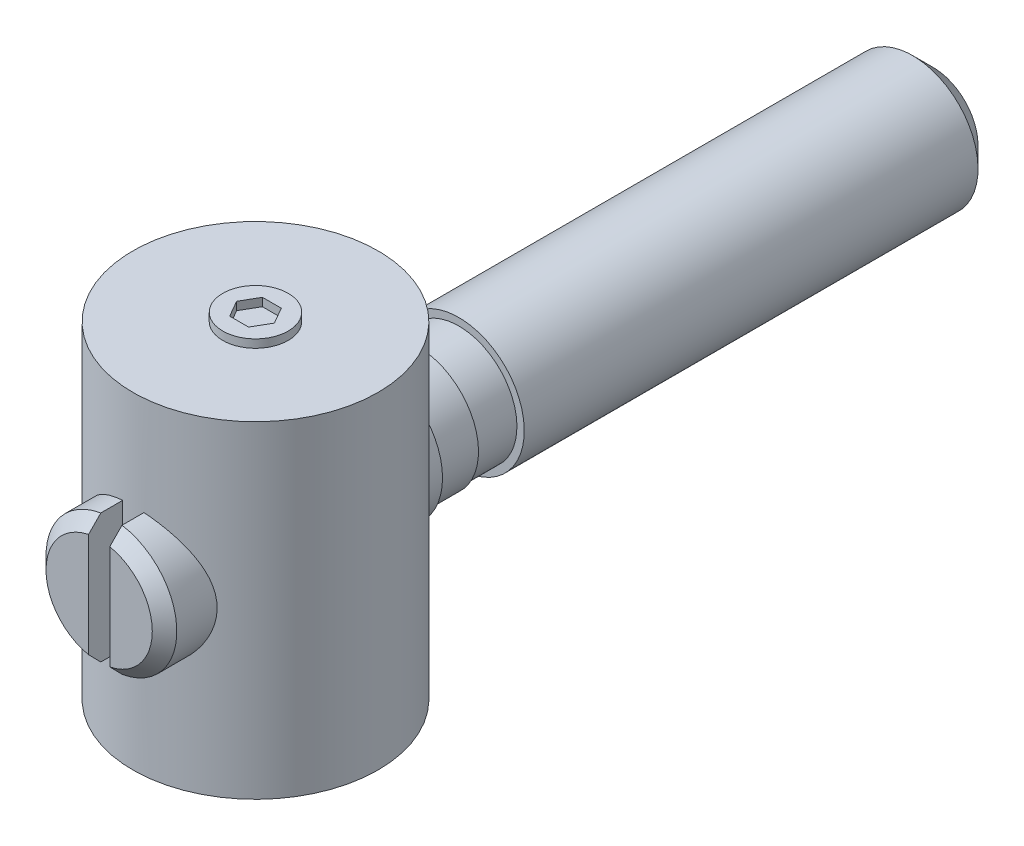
ISO-10303-21;
HEADER;
FILE_DESCRIPTION(('STEP AP214'),'2;1');
FILE_NAME('part.step','',(''),(''),'','','');
FILE_SCHEMA(('AUTOMOTIVE_DESIGN { 1 0 10303 214 1 1 1 1 }'));
ENDSEC;
DATA;
#1=APPLICATION_CONTEXT('core data for automotive mechanical design processes');
#2=APPLICATION_PROTOCOL_DEFINITION('international standard','automotive_design',2000,#1);
#3=PRODUCT_CONTEXT('',#1,'mechanical');
#4=PRODUCT('Part','Part','',(#3));
#5=PRODUCT_RELATED_PRODUCT_CATEGORY('part','',(#4));
#6=PRODUCT_DEFINITION_FORMATION('','',#4);
#7=PRODUCT_DEFINITION_CONTEXT('part definition',#1,'design');
#8=PRODUCT_DEFINITION('design','',#6,#7);
#9=PRODUCT_DEFINITION_SHAPE('','',#8);
#10=(LENGTH_UNIT() NAMED_UNIT(*) SI_UNIT(.MILLI.,.METRE.));
#11=(NAMED_UNIT(*) PLANE_ANGLE_UNIT() SI_UNIT($,.RADIAN.));
#12=(NAMED_UNIT(*) SI_UNIT($,.STERADIAN.) SOLID_ANGLE_UNIT());
#13=UNCERTAINTY_MEASURE_WITH_UNIT(LENGTH_MEASURE(1.E-05),#10,'distance_accuracy_value','');
#14=(GEOMETRIC_REPRESENTATION_CONTEXT(3) GLOBAL_UNCERTAINTY_ASSIGNED_CONTEXT((#13)) GLOBAL_UNIT_ASSIGNED_CONTEXT((#10,
#11,#12)) REPRESENTATION_CONTEXT('',''));
#15=CARTESIAN_POINT('',(0.,0.,0.));
#16=DIRECTION('',(0.,0.,1.));
#17=DIRECTION('',(1.,0.,0.));
#18=AXIS2_PLACEMENT_3D('',#15,#16,#17);
#19=CARTESIAN_POINT('',(0.,0.,9.56172630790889));
#20=DIRECTION('',(0.,0.,-1.));
#21=DIRECTION('',(0.,1.,0.));
#22=AXIS2_PLACEMENT_3D('',#19,#20,#21);
#23=PLANE('',#22);
#24=CARTESIAN_POINT('',(0.,0.,9.56172630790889));
#25=DIRECTION('',(0.,0.,-1.));
#26=DIRECTION('',(0.,1.,0.));
#27=AXIS2_PLACEMENT_3D('',#24,#25,#26);
#28=CIRCLE('',#27,3.25);
#29=CARTESIAN_POINT('',(0.65,-3.18433666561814,9.56172630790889));
#30=VERTEX_POINT('',#29);
#31=CARTESIAN_POINT('',(0.65,3.18433666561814,9.56172630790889));
#32=VERTEX_POINT('',#31);
#33=EDGE_CURVE('E181',#30,#32,#28,.F.);
#34=ORIENTED_EDGE('',*,*,#33,.T.);
#35=DIRECTION('',(0.,1.,0.));
#36=VECTOR('',#35,1.);
#37=CARTESIAN_POINT('',(0.65,3.94683417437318,9.56172630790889));
#38=LINE('',#37,#36);
#39=EDGE_CURVE('E370',#30,#32,#38,.T.);
#40=ORIENTED_EDGE('',*,*,#39,.F.);
#41=EDGE_LOOP('',(#34,#40));
#42=FACE_BOUND('',#41,.T.);
#43=ADVANCED_FACE('F14',(#42),#23,.F.);
#44=CARTESIAN_POINT('',(0.,0.,9.56172630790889));
#45=DIRECTION('',(0.,0.,-1.));
#46=DIRECTION('',(0.,1.,0.));
#47=AXIS2_PLACEMENT_3D('',#44,#45,#46);
#48=CONICAL_SURFACE('',#47,3.25,0.785398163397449);
#49=CARTESIAN_POINT('',(0.65,-8.70456504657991,4.08292612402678));
#50=CARTESIAN_POINT('',(0.650000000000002,-8.39669211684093,4.38993683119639));
#51=CARTESIAN_POINT('',(0.650000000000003,-8.0887810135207,4.69690929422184));
#52=CARTESIAN_POINT('',(0.650000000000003,-7.47282030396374,5.31073608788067));
#53=CARTESIAN_POINT('',(0.650000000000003,-7.16477069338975,5.61759041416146));
#54=CARTESIAN_POINT('',(0.650000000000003,-6.54823771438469,6.23137130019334));
#55=CARTESIAN_POINT('',(0.650000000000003,-6.23975419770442,6.53829771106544));
#56=CARTESIAN_POINT('',(0.650000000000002,-5.62251880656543,7.15186027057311));
#57=CARTESIAN_POINT('',(0.650000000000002,-5.31376694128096,7.45849642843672));
#58=CARTESIAN_POINT('',(0.650000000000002,-4.70842903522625,8.05879904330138));
#59=CARTESIAN_POINT('',(0.650000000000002,-4.41186110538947,8.35248374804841));
#60=CARTESIAN_POINT('',(0.650000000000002,-3.96643026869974,8.79245463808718));
#61=CARTESIAN_POINT('',(0.650000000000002,-3.81784936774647,8.9390262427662));
#62=CARTESIAN_POINT('',(0.650000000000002,-3.52042094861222,9.23189584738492));
#63=CARTESIAN_POINT('',(0.650000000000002,-3.3715734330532,9.37819384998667));
#64=CARTESIAN_POINT('',(0.650000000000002,-3.07356536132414,9.67032043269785));
#65=CARTESIAN_POINT('',(0.650000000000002,-2.92440500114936,9.81614921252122));
#66=CARTESIAN_POINT('',(0.650000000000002,-2.62547929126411,10.1071967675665));
#67=CARTESIAN_POINT('',(0.650000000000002,-2.47571391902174,10.2524155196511));
#68=CARTESIAN_POINT('',(0.650000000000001,-2.17523512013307,10.5418211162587));
#69=CARTESIAN_POINT('',(0.650000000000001,-2.02452186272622,10.6860081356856));
#70=CARTESIAN_POINT('',(0.650000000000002,-1.79709748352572,10.9008470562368));
#71=CARTESIAN_POINT('',(0.650000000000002,-1.72106595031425,10.9722176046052));
#72=CARTESIAN_POINT('',(0.650000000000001,-1.56834745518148,11.1142531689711));
#73=CARTESIAN_POINT('',(0.65,-1.49166050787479,11.1849182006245));
#74=CARTESIAN_POINT('',(0.65,-1.37166741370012,11.2939463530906));
#75=CARTESIAN_POINT('',(0.650000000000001,-1.32870103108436,11.3326831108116));
#76=CARTESIAN_POINT('',(0.650000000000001,-1.24237376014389,11.4097235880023));
#77=CARTESIAN_POINT('',(0.650000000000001,-1.19901283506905,11.4480272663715));
#78=CARTESIAN_POINT('',(0.650000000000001,-1.11149374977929,11.5243047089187));
#79=CARTESIAN_POINT('',(0.650000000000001,-1.06733221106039,11.5622746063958));
#80=CARTESIAN_POINT('',(0.650000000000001,-0.978331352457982,11.6373918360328));
#81=CARTESIAN_POINT('',(0.65,-0.933492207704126,11.6745393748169));
#82=CARTESIAN_POINT('',(0.65,-0.842526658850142,11.7479491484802));
#83=CARTESIAN_POINT('',(0.650000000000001,-0.796393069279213,11.7842025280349));
#84=CARTESIAN_POINT('',(0.650000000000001,-0.702784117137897,11.8549284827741));
#85=CARTESIAN_POINT('',(0.650000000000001,-0.655309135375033,11.8894015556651));
#86=CARTESIAN_POINT('',(0.650000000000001,-0.558661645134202,11.9553647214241));
#87=CARTESIAN_POINT('',(0.650000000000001,-0.509499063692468,11.9868691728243));
#88=CARTESIAN_POINT('',(0.650000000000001,-0.408485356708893,12.0451389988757));
#89=CARTESIAN_POINT('',(0.65,-0.356641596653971,12.0719165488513));
#90=CARTESIAN_POINT('',(0.65,-0.262880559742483,12.1115179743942));
#91=CARTESIAN_POINT('',(0.650000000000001,-0.221756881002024,12.1261577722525));
#92=CARTESIAN_POINT('',(0.650000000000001,-0.137737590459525,12.1485042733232));
#93=CARTESIAN_POINT('',(0.65,-0.0948516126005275,12.1562444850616));
#94=CARTESIAN_POINT('',(0.65,-0.0297912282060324,12.1614144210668));
#95=CARTESIAN_POINT('',(0.650000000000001,-0.00785059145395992,12.162048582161));
#96=CARTESIAN_POINT('',(0.650000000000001,0.0359816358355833,12.1610997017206));
#97=CARTESIAN_POINT('',(0.650000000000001,0.0578732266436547,12.1595166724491));
#98=CARTESIAN_POINT('',(0.650000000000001,0.12326366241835,12.1515525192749));
#99=CARTESIAN_POINT('',(0.65,0.166388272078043,12.1419497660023));
#100=CARTESIAN_POINT('',(0.65,0.239287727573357,12.1197137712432));
#101=CARTESIAN_POINT('',(0.650000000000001,0.269558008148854,12.1085697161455));
#102=CARTESIAN_POINT('',(0.650000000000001,0.329032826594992,12.0836907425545));
#103=CARTESIAN_POINT('',(0.650000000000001,0.358236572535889,12.0699539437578));
#104=CARTESIAN_POINT('',(0.650000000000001,0.415789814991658,12.0405159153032));
#105=CARTESIAN_POINT('',(0.650000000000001,0.444134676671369,12.0248057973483));
#106=CARTESIAN_POINT('',(0.650000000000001,0.499980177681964,11.9919879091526));
#107=CARTESIAN_POINT('',(0.65,0.527481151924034,11.9748807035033));
#108=CARTESIAN_POINT('',(0.65,0.586863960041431,11.9363365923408));
#109=CARTESIAN_POINT('',(0.650000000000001,0.618606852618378,11.914687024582));
#110=CARTESIAN_POINT('',(0.650000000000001,0.681342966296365,11.8703234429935));
#111=CARTESIAN_POINT('',(0.650000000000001,0.712336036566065,11.8476092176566));
#112=CARTESIAN_POINT('',(0.65,0.804479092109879,11.778269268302));
#113=CARTESIAN_POINT('',(0.650000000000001,0.864747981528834,11.7304766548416));
#114=CARTESIAN_POINT('',(0.650000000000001,0.983937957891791,11.6329671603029));
#115=CARTESIAN_POINT('',(0.650000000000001,1.04285527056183,11.5832457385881));
#116=CARTESIAN_POINT('',(0.650000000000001,1.15965766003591,11.4826566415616));
#117=CARTESIAN_POINT('',(0.650000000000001,1.21754315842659,11.4317894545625));
#118=CARTESIAN_POINT('',(0.650000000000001,1.33273717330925,11.3291590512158));
#119=CARTESIAN_POINT('',(0.650000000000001,1.39004416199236,11.2773941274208));
#120=CARTESIAN_POINT('',(0.650000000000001,1.50415468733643,11.1733014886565));
#121=CARTESIAN_POINT('',(0.65,1.56095817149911,11.1209737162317));
#122=CARTESIAN_POINT('',(0.65,1.67409623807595,11.0159939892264));
#123=CARTESIAN_POINT('',(0.650000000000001,1.73043142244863,10.9633426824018));
#124=CARTESIAN_POINT('',(0.65,1.84281062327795,10.8577345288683));
#125=CARTESIAN_POINT('',(0.65,1.89885465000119,10.8047776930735));
#126=CARTESIAN_POINT('',(0.65,2.06557383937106,10.6465791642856));
#127=CARTESIAN_POINT('',(0.65,2.17592358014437,10.5409946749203));
#128=CARTESIAN_POINT('',(0.650000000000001,2.39606249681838,10.3292425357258));
#129=CARTESIAN_POINT('',(0.65,2.50585166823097,10.2230748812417));
#130=CARTESIAN_POINT('',(0.65,2.83466232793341,9.90398407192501));
#131=CARTESIAN_POINT('',(0.65,3.05311972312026,9.69047999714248));
#132=CARTESIAN_POINT('',(0.65,3.48939994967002,9.26254806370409));
#133=CARTESIAN_POINT('',(0.65,3.70722228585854,9.04811970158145));
#134=CARTESIAN_POINT('',(0.65,4.14239678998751,8.61879348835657));
#135=CARTESIAN_POINT('',(0.65,4.35974896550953,8.40389564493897));
#136=CARTESIAN_POINT('',(0.65,4.79359052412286,7.97436233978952));
#137=CARTESIAN_POINT('',(0.65,5.01008067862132,7.75972765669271));
#138=CARTESIAN_POINT('',(0.65,5.4428610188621,7.33025496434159));
#139=CARTESIAN_POINT('',(0.649999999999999,5.65915120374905,7.11541695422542));
#140=CARTESIAN_POINT('',(0.65,6.30773962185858,6.47076507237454));
#141=CARTESIAN_POINT('',(0.650000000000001,6.73982880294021,6.04074089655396));
#142=CARTESIAN_POINT('',(0.65,7.29947848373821,5.48337298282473));
#143=CARTESIAN_POINT('',(0.649999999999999,7.42717743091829,5.35616816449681));
#144=CARTESIAN_POINT('',(0.649999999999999,7.68255536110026,5.10173055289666));
#145=CARTESIAN_POINT('',(0.649999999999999,7.81023434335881,4.9744977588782));
#146=CARTESIAN_POINT('',(0.649999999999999,8.065700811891,4.71988341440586));
#147=CARTESIAN_POINT('',(0.649999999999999,8.19348827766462,4.59250184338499));
#148=CARTESIAN_POINT('',(0.649999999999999,8.44904139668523,4.33772478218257));
#149=CARTESIAN_POINT('',(0.649999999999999,8.57680705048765,4.21032929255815));
#150=CARTESIAN_POINT('',(0.65,8.70456504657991,4.08292612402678));
#151=B_SPLINE_CURVE_WITH_KNOTS('',3,(#49,#50,#51,#52,#53,#54,#55,#56,#57,#58,#59,#60,#61,#62,
#63,#64,#65,#66,#67,#68,#69,#70,#71,#72,#73,#74,#75,#76,#77,#78,#79,#80,#81,#82,#83,#84,#85,#86,
#87,#88,#89,#90,#91,#92,#93,#94,#95,#96,#97,#98,#99,#100,#101,#102,#103,#104,#105,#106,#107,
#108,#109,#110,#111,#112,#113,#114,#115,#116,#117,#118,#119,#120,#121,#122,#123,#124,#125,#126,
#127,#128,#129,#130,#131,#132,#133,#134,#135,#136,#137,#138,#139,#140,#141,#142,#143,#144,#145,
#146,#147,#148,#149,#150),.UNSPECIFIED.,.F.,.F.,(4,2,2,2,2,2,2,2,2,2,2,2,2,2,2,2,2,2,2,2,2,2,2,
2,2,2,2,2,2,2,2,2,2,2,2,2,2,2,2,2,2,2,2,2,2,2,2,2,2,2,4),(0.,1.30436648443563,2.60877714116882,
3.91426279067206,5.21970543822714,6.47183438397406,7.0979616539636,7.72408279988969,
8.34988782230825,8.97571636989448,9.60143618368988,9.9142769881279,10.2271108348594,
10.4006593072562,10.5742241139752,10.7489387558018,10.9236089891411,11.0996044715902,
11.2755504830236,11.4505963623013,11.6251845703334,11.755746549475,11.8856709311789,
11.9514152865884,12.0171592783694,12.1489127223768,12.2455611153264,12.3422798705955,
12.4394510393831,12.5365831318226,12.6518208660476,12.7670815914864,12.9977655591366,
13.229030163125,13.4601980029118,13.6918683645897,13.9235626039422,14.1548884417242,
14.3862060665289,14.8443792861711,15.3025561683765,16.2189399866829,17.1359098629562,
18.0528648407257,18.9674270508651,19.881993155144,21.7108166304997,22.2515501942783,
22.7923005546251,23.3335965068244,23.8748755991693),.UNSPECIFIED.);
#152=CARTESIAN_POINT('',(0.65,-3.94683417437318,8.81172630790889));
#153=VERTEX_POINT('',#152);
#154=EDGE_CURVE('E95',#153,#30,#151,.T.);
#155=ORIENTED_EDGE('',*,*,#154,.F.);
#156=CARTESIAN_POINT('',(0.,0.,8.81172630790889));
#157=DIRECTION('',(0.,0.,-1.));
#158=DIRECTION('',(0.,1.,0.));
#159=AXIS2_PLACEMENT_3D('',#156,#157,#158);
#160=CIRCLE('',#159,4.);
#161=CARTESIAN_POINT('',(0.65,3.94683417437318,8.81172630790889));
#162=VERTEX_POINT('',#161);
#163=EDGE_CURVE('E186',#162,#153,#160,.T.);
#164=ORIENTED_EDGE('',*,*,#163,.F.);
#165=EDGE_CURVE('E195',#32,#162,#151,.T.);
#166=ORIENTED_EDGE('',*,*,#165,.F.);
#167=ORIENTED_EDGE('',*,*,#33,.F.);
#168=EDGE_LOOP('',(#155,#164,#166,#167));
#169=FACE_BOUND('',#168,.T.);
#170=ADVANCED_FACE('F211',(#169),#48,.T.);
#171=CARTESIAN_POINT('',(0.,0.,39.8570922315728));
#172=DIRECTION('',(0.,0.,1.));
#173=DIRECTION('',(0.,-1.,0.));
#174=AXIS2_PLACEMENT_3D('',#171,#172,#173);
#175=CYLINDRICAL_SURFACE('',#174,4.);
#176=CARTESIAN_POINT('',(0.,-4.,7.5));
#177=CARTESIAN_POINT('',(-0.104329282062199,-4.00000040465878,7.5000003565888));
#178=CARTESIAN_POINT('',(-0.20865297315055,-3.9959139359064,7.49781838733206));
#179=CARTESIAN_POINT('',(-0.416519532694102,-3.97962111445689,7.48914792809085));
#180=CARTESIAN_POINT('',(-0.520062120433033,-3.96741197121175,7.48265795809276));
#181=CARTESIAN_POINT('',(-0.725661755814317,-3.93500361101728,7.46552494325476));
#182=CARTESIAN_POINT('',(-0.827717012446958,-3.91479547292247,7.45487726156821));
#183=CARTESIAN_POINT('',(-1.02950974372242,-3.86663812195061,7.429702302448));
#184=CARTESIAN_POINT('',(-1.12924625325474,-3.83868574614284,7.41517343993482));
#185=CARTESIAN_POINT('',(-1.42307484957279,-3.74392721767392,7.36641110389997));
#186=CARTESIAN_POINT('',(-1.61285610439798,-3.66604732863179,7.32690726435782));
#187=CARTESIAN_POINT('',(-1.9762088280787,-3.4836808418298,7.23738512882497));
#188=CARTESIAN_POINT('',(-2.14978022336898,-3.37919412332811,7.18736678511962));
#189=CARTESIAN_POINT('',(-2.48882838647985,-3.13874131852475,7.07739524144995));
#190=CARTESIAN_POINT('',(-2.65301196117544,-3.00115110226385,7.01700391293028));
#191=CARTESIAN_POINT('',(-2.95716832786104,-2.70199516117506,6.89435393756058));
#192=CARTESIAN_POINT('',(-3.09711991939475,-2.54040866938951,6.83209371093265));
#193=CARTESIAN_POINT('',(-3.36178904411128,-2.18006310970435,6.70609881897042));
#194=CARTESIAN_POINT('',(-3.48395288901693,-1.9792578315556,6.64274760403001));
#195=CARTESIAN_POINT('',(-3.64013044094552,-1.66233743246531,6.55766590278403));
#196=CARTESIAN_POINT('',(-3.68768940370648,-1.55404047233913,6.53095573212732));
#197=CARTESIAN_POINT('',(-3.77327802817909,-1.33282028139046,6.48188273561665));
#198=CARTESIAN_POINT('',(-3.8113136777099,-1.21990000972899,6.45951718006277));
#199=CARTESIAN_POINT('',(-3.87528400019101,-0.997366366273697,6.42132989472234));
#200=CARTESIAN_POINT('',(-3.90182208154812,-0.887981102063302,6.40518874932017));
#201=CARTESIAN_POINT('',(-3.94564516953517,-0.666772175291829,6.37828721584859));
#202=CARTESIAN_POINT('',(-3.9629354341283,-0.554949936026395,6.36752377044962));
#203=CARTESIAN_POINT('',(-3.9879763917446,-0.329923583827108,6.35187091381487));
#204=CARTESIAN_POINT('',(-3.99573492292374,-0.21672068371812,6.3469766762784));
#205=CARTESIAN_POINT('',(-4.00159448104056,0.0100266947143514,6.34328425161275));
#206=CARTESIAN_POINT('',(-3.99969667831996,0.123571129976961,6.34448532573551));
#207=CARTESIAN_POINT('',(-3.98722972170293,0.333880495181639,6.35232566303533));
#208=CARTESIAN_POINT('',(-3.97792191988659,0.430752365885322,6.35817365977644));
#209=CARTESIAN_POINT('',(-3.95234427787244,0.62322962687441,6.37410335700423));
#210=CARTESIAN_POINT('',(-3.93607229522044,0.718834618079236,6.38418636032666));
#211=CARTESIAN_POINT('',(-3.87707963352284,1.00276725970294,6.42031483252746));
#212=CARTESIAN_POINT('',(-3.82417439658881,1.18833960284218,6.45224517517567));
#213=CARTESIAN_POINT('',(-3.69194831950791,1.55171916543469,6.52881406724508));
#214=CARTESIAN_POINT('',(-3.61206074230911,1.72925828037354,6.57372199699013));
#215=CARTESIAN_POINT('',(-3.42858159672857,2.06934086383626,6.67125272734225));
#216=CARTESIAN_POINT('',(-3.32497952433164,2.23187764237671,6.72387894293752));
#217=CARTESIAN_POINT('',(-3.07935066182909,2.56242703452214,6.84022433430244));
#218=CARTESIAN_POINT('',(-2.93391468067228,2.72773501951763,6.90443725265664));
#219=CARTESIAN_POINT('',(-2.6172236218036,3.03289545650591,7.03058565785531));
#220=CARTESIAN_POINT('',(-2.44595290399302,3.17273237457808,7.09251973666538));
#221=CARTESIAN_POINT('',(-2.16676749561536,3.36435932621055,7.18091003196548));
#222=CARTESIAN_POINT('',(-2.06686725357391,3.42666004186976,7.21036936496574));
#223=CARTESIAN_POINT('',(-1.86130318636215,3.54252047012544,7.26614530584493));
#224=CARTESIAN_POINT('',(-1.75564184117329,3.59608390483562,7.29246325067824));
#225=CARTESIAN_POINT('',(-1.53927716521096,3.69387554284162,7.34117979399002));
#226=CARTESIAN_POINT('',(-1.42857623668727,3.73810813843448,7.36358023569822));
#227=CARTESIAN_POINT('',(-1.20291776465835,3.81670749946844,7.40379052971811));
#228=CARTESIAN_POINT('',(-1.08796078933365,3.85107557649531,7.42160099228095));
#229=CARTESIAN_POINT('',(-0.865261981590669,3.90682600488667,7.45068973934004));
#230=CARTESIAN_POINT('',(-0.757800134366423,3.92909777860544,7.46241120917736));
#231=CARTESIAN_POINT('',(-0.541018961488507,3.96476496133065,7.48125196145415));
#232=CARTESIAN_POINT('',(-0.431699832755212,3.97816130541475,7.48837172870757));
#233=CARTESIAN_POINT('',(-0.212172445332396,3.99588587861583,7.49780284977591));
#234=CARTESIAN_POINT('',(-0.101964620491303,4.00021829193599,7.50011642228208));
#235=CARTESIAN_POINT('',(0.118422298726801,3.99976477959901,7.4998745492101));
#236=CARTESIAN_POINT('',(0.228601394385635,3.99497937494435,7.49731938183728));
#237=CARTESIAN_POINT('',(0.437982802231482,3.97720766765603,7.48786549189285));
#238=CARTESIAN_POINT('',(0.537271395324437,3.96500748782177,7.48138330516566));
#239=CARTESIAN_POINT('',(0.734354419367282,3.93328142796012,7.46461842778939));
#240=CARTESIAN_POINT('',(0.832148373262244,3.9137532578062,7.4543345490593));
#241=CARTESIAN_POINT('',(1.12223852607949,3.84447795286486,7.41811350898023));
#242=CARTESIAN_POINT('',(1.31143028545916,3.78402368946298,7.38679785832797));
#243=CARTESIAN_POINT('',(1.68128124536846,3.63512086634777,7.31162738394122));
#244=CARTESIAN_POINT('',(1.86161005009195,3.54601184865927,7.26747936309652));
#245=CARTESIAN_POINT('',(2.20530240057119,3.34312620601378,7.1706722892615));
#246=CARTESIAN_POINT('',(2.36865928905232,3.22933995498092,7.11800991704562));
#247=CARTESIAN_POINT('',(2.69245168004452,2.96627213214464,7.00238186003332));
#248=CARTESIAN_POINT('',(2.85067860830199,2.81448780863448,6.93891733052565));
#249=CARTESIAN_POINT('',(3.14054502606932,2.48694968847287,6.8126367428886));
#250=CARTESIAN_POINT('',(3.27215988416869,2.31117393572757,6.74982133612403));
#251=CARTESIAN_POINT('',(3.51371844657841,1.92581246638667,6.62747054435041));
#252=CARTESIAN_POINT('',(3.62160676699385,1.71474727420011,6.56844065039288));
#253=CARTESIAN_POINT('',(3.75479280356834,1.38408550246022,6.49262165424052));
#254=CARTESIAN_POINT('',(3.79441212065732,1.2715285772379,6.46947070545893));
#255=CARTESIAN_POINT('',(3.86363310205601,1.04241683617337,6.42837188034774));
#256=CARTESIAN_POINT('',(3.89323655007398,0.925862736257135,6.41042307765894));
#257=CARTESIAN_POINT('',(3.93952982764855,0.701376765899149,6.38206607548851));
#258=CARTESIAN_POINT('',(3.9571999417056,0.593717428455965,6.37109180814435));
#259=CARTESIAN_POINT('',(3.98369950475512,0.376909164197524,6.35455615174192));
#260=CARTESIAN_POINT('',(3.99253018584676,0.267760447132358,6.34899400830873));
#261=CARTESIAN_POINT('',(4.00119558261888,0.0490176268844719,6.343537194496));
#262=CARTESIAN_POINT('',(4.00103521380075,-0.0605762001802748,6.34363942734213));
#263=CARTESIAN_POINT('',(3.99174615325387,-0.279197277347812,6.34948650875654));
#264=CARTESIAN_POINT('',(3.98261805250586,-0.388224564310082,6.3552309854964));
#265=CARTESIAN_POINT('',(3.94527417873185,-0.68659497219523,6.37853289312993));
#266=CARTESIAN_POINT('',(3.90785104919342,-0.874437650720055,6.40173425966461));
#267=CARTESIAN_POINT('',(3.80746909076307,-1.24070660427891,6.46192910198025));
#268=CARTESIAN_POINT('',(3.74450079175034,-1.41912935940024,6.49892769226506));
#269=CARTESIAN_POINT('',(3.59040170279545,-1.77451283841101,6.58538478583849));
#270=CARTESIAN_POINT('',(3.4977179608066,-1.950638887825,6.63549242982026));
#271=CARTESIAN_POINT('',(3.28835420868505,-2.28601363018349,6.74169802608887));
#272=CARTESIAN_POINT('',(3.17166127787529,-2.44525316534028,6.7977991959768));
#273=CARTESIAN_POINT('',(2.8979268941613,-2.76636004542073,6.91936180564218));
#274=CARTESIAN_POINT('',(2.73749066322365,-2.92527561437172,6.98500336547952));
#275=CARTESIAN_POINT('',(2.39071522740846,-3.21487945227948,7.11114874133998));
#276=CARTESIAN_POINT('',(2.20435938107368,-3.34554944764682,7.17164921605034));
#277=CARTESIAN_POINT('',(1.90608771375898,-3.51859665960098,7.2545091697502));
#278=CARTESIAN_POINT('',(1.80214051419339,-3.57297318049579,7.2810899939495));
#279=CARTESIAN_POINT('',(1.58915491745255,-3.67265414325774,7.33051892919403));
#280=CARTESIAN_POINT('',(1.48011905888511,-3.71796305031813,7.35336887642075));
#281=CARTESIAN_POINT('',(1.2579483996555,-3.79888380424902,7.39461358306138));
#282=CARTESIAN_POINT('',(1.14482237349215,-3.83451515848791,7.4130172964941));
#283=CARTESIAN_POINT('',(0.915246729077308,-3.89569281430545,7.44484645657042));
#284=CARTESIAN_POINT('',(0.798798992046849,-3.92124470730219,7.45827466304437));
#285=CARTESIAN_POINT('',(0.569078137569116,-3.96094679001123,7.47922653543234));
#286=CARTESIAN_POINT('',(0.455909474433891,-3.97557224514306,7.48699590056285));
#287=CARTESIAN_POINT('',(0.228491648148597,-3.99509868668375,7.49738246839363));
#288=CARTESIAN_POINT('',(0.114242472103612,-3.99999955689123,7.49999960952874));
#289=CARTESIAN_POINT('',(0.,-4.,7.5));
#290=B_SPLINE_CURVE_WITH_KNOTS('',3,(#176,#177,#178,#179,#180,#181,#182,#183,#184,#185,#186,
#187,#188,#189,#190,#191,#192,#193,#194,#195,#196,#197,#198,#199,#200,#201,#202,#203,#204,#205,
#206,#207,#208,#209,#210,#211,#212,#213,#214,#215,#216,#217,#218,#219,#220,#221,#222,#223,#224,
#225,#226,#227,#228,#229,#230,#231,#232,#233,#234,#235,#236,#237,#238,#239,#240,#241,#242,#243,
#244,#245,#246,#247,#248,#249,#250,#251,#252,#253,#254,#255,#256,#257,#258,#259,#260,#261,#262,
#263,#264,#265,#266,#267,#268,#269,#270,#271,#272,#273,#274,#275,#276,#277,#278,#279,#280,#281,
#282,#283,#284,#285,#286,#287,#288,#289),.UNSPECIFIED.,.T.,.F.,(4,2,2,2,2,2,2,2,2,2,2,2,2,2,2,2,
2,2,2,2,2,2,2,2,2,2,2,2,2,2,2,2,2,2,2,2,2,2,2,2,2,2,2,2,2,2,2,2,2,2,2,2,2,2,2,2,4),(0.,
0.312875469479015,0.625858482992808,0.939191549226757,1.25265277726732,1.87635275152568,
2.50005555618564,3.16498046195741,3.83048419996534,4.55668682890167,4.92002643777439,
5.28313701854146,5.6237663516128,5.96420180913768,6.30435713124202,6.64447122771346,
6.93659372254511,7.22880615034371,7.81285364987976,8.41002203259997,9.0074554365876,
9.69267368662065,10.3783084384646,10.7419894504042,11.1055151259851,11.4688692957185,
11.832175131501,12.1628321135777,12.4934542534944,12.8239237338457,13.1543743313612,
13.4547461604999,13.7552119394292,14.3555858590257,14.9709302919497,15.5865151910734,
16.2683843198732,16.9508817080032,17.6793249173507,18.0434998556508,18.407609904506,
18.736085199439,19.0645147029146,19.3927646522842,19.720992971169,20.2969971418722,
20.8732150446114,21.4865540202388,22.1002239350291,22.8026614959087,23.5055521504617,
23.8659835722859,24.2262370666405,24.5857589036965,24.9450810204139,25.2876812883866,
25.6302856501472),.UNSPECIFIED.);
#291=CARTESIAN_POINT('',(0.65,3.94683417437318,7.47178024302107));
#292=VERTEX_POINT('',#291);
#293=CARTESIAN_POINT('',(0.65,-3.94683417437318,7.47178024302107));
#294=VERTEX_POINT('',#293);
#295=EDGE_CURVE('E395',#292,#294,#290,.T.);
#296=ORIENTED_EDGE('',*,*,#295,.F.);
#297=DIRECTION('',(0.,0.,1.));
#298=VECTOR('',#297,1.);
#299=CARTESIAN_POINT('',(0.65,3.94683417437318,7.06172630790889));
#300=LINE('',#299,#298);
#301=EDGE_CURVE('E384',#292,#162,#300,.T.);
#302=ORIENTED_EDGE('',*,*,#301,.T.);
#303=ORIENTED_EDGE('',*,*,#163,.T.);
#304=DIRECTION('',(0.,0.,1.));
#305=VECTOR('',#304,1.);
#306=CARTESIAN_POINT('',(0.65,-3.94683417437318,7.06172630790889));
#307=LINE('',#306,#305);
#308=EDGE_CURVE('E376',#294,#153,#307,.T.);
#309=ORIENTED_EDGE('',*,*,#308,.F.);
#310=EDGE_LOOP('',(#296,#302,#303,#309));
#311=FACE_BOUND('',#310,.T.);
#312=ADVANCED_FACE('F220',(#311),#175,.T.);
#313=CARTESIAN_POINT('',(0.65,3.94683417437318,7.06172630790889));
#314=DIRECTION('',(1.,0.,0.));
#315=DIRECTION('',(0.,1.,0.));
#316=AXIS2_PLACEMENT_3D('',#313,#314,#315);
#317=PLANE('',#316);
#318=DIRECTION('',(0.,1.,0.));
#319=VECTOR('',#318,1.);
#320=CARTESIAN_POINT('',(0.65,-10.,7.47178024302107));
#321=LINE('',#320,#319);
#322=EDGE_CURVE('E387',#294,#292,#321,.T.);
#323=ORIENTED_EDGE('',*,*,#322,.F.);
#324=ORIENTED_EDGE('',*,*,#308,.T.);
#325=ORIENTED_EDGE('',*,*,#154,.T.);
#326=ORIENTED_EDGE('',*,*,#39,.T.);
#327=ORIENTED_EDGE('',*,*,#165,.T.);
#328=ORIENTED_EDGE('',*,*,#301,.F.);
#329=EDGE_LOOP('',(#323,#324,#325,#326,#327,#328));
#330=FACE_BOUND('',#329,.T.);
#331=ADVANCED_FACE('F215',(#330),#317,.F.);
#332=CARTESIAN_POINT('',(0.,10.,0.));
#333=DIRECTION('',(0.,1.,0.));
#334=DIRECTION('',(-1.,0.,0.));
#335=AXIS2_PLACEMENT_3D('',#332,#333,#334);
#336=PLANE('',#335);
#337=DIRECTION('',(-1.,0.,0.));
#338=VECTOR('',#337,1.);
#339=CARTESIAN_POINT('',(-0.57735026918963,10.,1.));
#340=LINE('',#339,#338);
#341=CARTESIAN_POINT('',(0.577350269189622,10.,1.));
#342=VERTEX_POINT('',#341);
#343=CARTESIAN_POINT('',(-0.57735026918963,10.,1.));
#344=VERTEX_POINT('',#343);
#345=EDGE_CURVE('E410',#342,#344,#340,.T.);
#346=ORIENTED_EDGE('',*,*,#345,.F.);
#347=DIRECTION('',(-0.5,0.,0.866025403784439));
#348=VECTOR('',#347,1.);
#349=CARTESIAN_POINT('',(0.577350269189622,10.,1.));
#350=LINE('',#349,#348);
#351=CARTESIAN_POINT('',(1.15470053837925,10.,0.));
#352=VERTEX_POINT('',#351);
#353=EDGE_CURVE('E407',#352,#342,#350,.T.);
#354=ORIENTED_EDGE('',*,*,#353,.F.);
#355=DIRECTION('',(0.5,0.,0.866025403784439));
#356=VECTOR('',#355,1.);
#357=CARTESIAN_POINT('',(1.15470053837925,10.,0.));
#358=LINE('',#357,#356);
#359=CARTESIAN_POINT('',(0.577350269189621,10.,-1.));
#360=VERTEX_POINT('',#359);
#361=EDGE_CURVE('E336',#360,#352,#358,.T.);
#362=ORIENTED_EDGE('',*,*,#361,.F.);
#363=DIRECTION('',(1.,0.,0.));
#364=VECTOR('',#363,1.);
#365=CARTESIAN_POINT('',(0.577350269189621,10.,-1.));
#366=LINE('',#365,#364);
#367=CARTESIAN_POINT('',(-0.57735026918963,10.,-1.));
#368=VERTEX_POINT('',#367);
#369=EDGE_CURVE('E404',#368,#360,#366,.T.);
#370=ORIENTED_EDGE('',*,*,#369,.F.);
#371=DIRECTION('',(0.5,0.,-0.866025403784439));
#372=VECTOR('',#371,1.);
#373=CARTESIAN_POINT('',(-0.57735026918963,10.,-1.));
#374=LINE('',#373,#372);
#375=CARTESIAN_POINT('',(-1.15470053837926,10.,0.));
#376=VERTEX_POINT('',#375);
#377=EDGE_CURVE('E86',#376,#368,#374,.T.);
#378=ORIENTED_EDGE('',*,*,#377,.F.);
#379=DIRECTION('',(-0.5,0.,-0.866025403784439));
#380=VECTOR('',#379,1.);
#381=CARTESIAN_POINT('',(-1.15470053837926,10.,0.));
#382=LINE('',#381,#380);
#383=EDGE_CURVE('E401',#344,#376,#382,.T.);
#384=ORIENTED_EDGE('',*,*,#383,.F.);
#385=EDGE_LOOP('',(#346,#354,#362,#370,#378,#384));
#386=FACE_BOUND('',#385,.T.);
#387=ADVANCED_FACE('F219',(#386),#336,.T.);
#388=CARTESIAN_POINT('',(-0.57735026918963,9.,1.));
#389=DIRECTION('',(0.,0.,1.));
#390=DIRECTION('',(1.,0.,0.));
#391=AXIS2_PLACEMENT_3D('',#388,#389,#390);
#392=PLANE('',#391);
#393=DIRECTION('',(0.,1.,0.));
#394=VECTOR('',#393,1.);
#395=CARTESIAN_POINT('',(0.577350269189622,9.,1.));
#396=LINE('',#395,#394);
#397=CARTESIAN_POINT('',(0.577350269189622,10.5,1.));
#398=VERTEX_POINT('',#397);
#399=EDGE_CURVE('E346',#342,#398,#396,.T.);
#400=ORIENTED_EDGE('',*,*,#399,.F.);
#401=ORIENTED_EDGE('',*,*,#345,.T.);
#402=DIRECTION('',(0.,1.,0.));
#403=VECTOR('',#402,1.);
#404=CARTESIAN_POINT('',(-0.57735026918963,9.,1.));
#405=LINE('',#404,#403);
#406=CARTESIAN_POINT('',(-0.57735026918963,10.5,1.));
#407=VERTEX_POINT('',#406);
#408=EDGE_CURVE('E80',#344,#407,#405,.T.);
#409=ORIENTED_EDGE('',*,*,#408,.T.);
#410=DIRECTION('',(1.,0.,0.));
#411=VECTOR('',#410,1.);
#412=CARTESIAN_POINT('',(-0.57735026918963,10.5,1.));
#413=LINE('',#412,#411);
#414=EDGE_CURVE('E359',#407,#398,#413,.T.);
#415=ORIENTED_EDGE('',*,*,#414,.T.);
#416=EDGE_LOOP('',(#400,#401,#409,#415));
#417=FACE_BOUND('',#416,.T.);
#418=ADVANCED_FACE('F299',(#417),#392,.F.);
#419=CARTESIAN_POINT('',(0.577350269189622,9.,1.));
#420=DIRECTION('',(0.866025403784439,0.,0.5));
#421=DIRECTION('',(0.5,0.,-0.866025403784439));
#422=AXIS2_PLACEMENT_3D('',#419,#420,#421);
#423=PLANE('',#422);
#424=DIRECTION('',(0.,1.,0.));
#425=VECTOR('',#424,1.);
#426=CARTESIAN_POINT('',(1.15470053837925,9.,0.));
#427=LINE('',#426,#425);
#428=CARTESIAN_POINT('',(1.15470053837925,10.5,0.));
#429=VERTEX_POINT('',#428);
#430=EDGE_CURVE('E343',#352,#429,#427,.T.);
#431=ORIENTED_EDGE('',*,*,#430,.F.);
#432=ORIENTED_EDGE('',*,*,#353,.T.);
#433=ORIENTED_EDGE('',*,*,#399,.T.);
#434=DIRECTION('',(0.5,0.,-0.866025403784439));
#435=VECTOR('',#434,1.);
#436=CARTESIAN_POINT('',(0.577350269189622,10.5,1.));
#437=LINE('',#436,#435);
#438=EDGE_CURVE('E356',#398,#429,#437,.T.);
#439=ORIENTED_EDGE('',*,*,#438,.T.);
#440=EDGE_LOOP('',(#431,#432,#433,#439));
#441=FACE_BOUND('',#440,.T.);
#442=ADVANCED_FACE('F304',(#441),#423,.F.);
#443=CARTESIAN_POINT('',(1.15470053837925,9.,0.));
#444=DIRECTION('',(0.866025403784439,0.,-0.5));
#445=DIRECTION('',(-0.5,0.,-0.866025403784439));
#446=AXIS2_PLACEMENT_3D('',#443,#444,#445);
#447=PLANE('',#446);
#448=DIRECTION('',(0.,1.,0.));
#449=VECTOR('',#448,1.);
#450=CARTESIAN_POINT('',(0.577350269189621,9.,-1.));
#451=LINE('',#450,#449);
#452=CARTESIAN_POINT('',(0.577350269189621,10.5,-1.));
#453=VERTEX_POINT('',#452);
#454=EDGE_CURVE('E335',#360,#453,#451,.T.);
#455=ORIENTED_EDGE('',*,*,#454,.F.);
#456=ORIENTED_EDGE('',*,*,#361,.T.);
#457=ORIENTED_EDGE('',*,*,#430,.T.);
#458=DIRECTION('',(-0.5,0.,-0.866025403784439));
#459=VECTOR('',#458,1.);
#460=CARTESIAN_POINT('',(1.15470053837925,10.5,0.));
#461=LINE('',#460,#459);
#462=EDGE_CURVE('E339',#429,#453,#461,.T.);
#463=ORIENTED_EDGE('',*,*,#462,.T.);
#464=EDGE_LOOP('',(#455,#456,#457,#463));
#465=FACE_BOUND('',#464,.T.);
#466=ADVANCED_FACE('F324',(#465),#447,.F.);
#467=CARTESIAN_POINT('',(0.577350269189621,9.,-1.));
#468=DIRECTION('',(0.,0.,-1.));
#469=DIRECTION('',(-1.,0.,0.));
#470=AXIS2_PLACEMENT_3D('',#467,#468,#469);
#471=PLANE('',#470);
#472=DIRECTION('',(0.,1.,0.));
#473=VECTOR('',#472,1.);
#474=CARTESIAN_POINT('',(-0.57735026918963,9.,-1.));
#475=LINE('',#474,#473);
#476=CARTESIAN_POINT('',(-0.57735026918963,10.5,-1.));
#477=VERTEX_POINT('',#476);
#478=EDGE_CURVE('E344',#368,#477,#475,.T.);
#479=ORIENTED_EDGE('',*,*,#478,.F.);
#480=ORIENTED_EDGE('',*,*,#369,.T.);
#481=ORIENTED_EDGE('',*,*,#454,.T.);
#482=DIRECTION('',(-1.,0.,0.));
#483=VECTOR('',#482,1.);
#484=CARTESIAN_POINT('',(0.577350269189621,10.5,-1.));
#485=LINE('',#484,#483);
#486=EDGE_CURVE('E352',#453,#477,#485,.T.);
#487=ORIENTED_EDGE('',*,*,#486,.T.);
#488=EDGE_LOOP('',(#479,#480,#481,#487));
#489=FACE_BOUND('',#488,.T.);
#490=ADVANCED_FACE('F253',(#489),#471,.F.);
#491=CARTESIAN_POINT('',(-0.57735026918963,9.,-1.));
#492=DIRECTION('',(-0.866025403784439,0.,-0.5));
#493=DIRECTION('',(-0.5,0.,0.866025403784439));
#494=AXIS2_PLACEMENT_3D('',#491,#492,#493);
#495=PLANE('',#494);
#496=DIRECTION('',(0.,1.,0.));
#497=VECTOR('',#496,1.);
#498=CARTESIAN_POINT('',(-1.15470053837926,9.,0.));
#499=LINE('',#498,#497);
#500=CARTESIAN_POINT('',(-1.15470053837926,10.5,0.));
#501=VERTEX_POINT('',#500);
#502=EDGE_CURVE('E354',#376,#501,#499,.T.);
#503=ORIENTED_EDGE('',*,*,#502,.F.);
#504=ORIENTED_EDGE('',*,*,#377,.T.);
#505=ORIENTED_EDGE('',*,*,#478,.T.);
#506=DIRECTION('',(-0.5,0.,0.866025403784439));
#507=VECTOR('',#506,1.);
#508=CARTESIAN_POINT('',(-0.57735026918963,10.5,-1.));
#509=LINE('',#508,#507);
#510=EDGE_CURVE('E363',#477,#501,#509,.T.);
#511=ORIENTED_EDGE('',*,*,#510,.T.);
#512=EDGE_LOOP('',(#503,#504,#505,#511));
#513=FACE_BOUND('',#512,.T.);
#514=ADVANCED_FACE('F316',(#513),#495,.F.);
#515=CARTESIAN_POINT('',(-1.15470053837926,9.,0.));
#516=DIRECTION('',(-0.866025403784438,0.,0.5));
#517=DIRECTION('',(0.5,0.,0.866025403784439));
#518=AXIS2_PLACEMENT_3D('',#515,#516,#517);
#519=PLANE('',#518);
#520=ORIENTED_EDGE('',*,*,#408,.F.);
#521=ORIENTED_EDGE('',*,*,#383,.T.);
#522=ORIENTED_EDGE('',*,*,#502,.T.);
#523=DIRECTION('',(0.5,0.,0.866025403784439));
#524=VECTOR('',#523,1.);
#525=CARTESIAN_POINT('',(-1.15470053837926,10.5,0.));
#526=LINE('',#525,#524);
#527=EDGE_CURVE('E361',#501,#407,#526,.T.);
#528=ORIENTED_EDGE('',*,*,#527,.T.);
#529=EDGE_LOOP('',(#520,#521,#522,#528));
#530=FACE_BOUND('',#529,.T.);
#531=ADVANCED_FACE('F314',(#530),#519,.F.);
#532=CARTESIAN_POINT('',(0.,10.5,0.));
#533=DIRECTION('',(0.,-1.,0.));
#534=DIRECTION('',(1.,0.,0.));
#535=AXIS2_PLACEMENT_3D('',#532,#533,#534);
#536=PLANE('',#535);
#537=ORIENTED_EDGE('',*,*,#527,.F.);
#538=ORIENTED_EDGE('',*,*,#510,.F.);
#539=ORIENTED_EDGE('',*,*,#486,.F.);
#540=ORIENTED_EDGE('',*,*,#462,.F.);
#541=ORIENTED_EDGE('',*,*,#438,.F.);
#542=ORIENTED_EDGE('',*,*,#414,.F.);
#543=EDGE_LOOP('',(#537,#538,#539,#540,#541,#542));
#544=FACE_BOUND('',#543,.T.);
#545=CARTESIAN_POINT('',(0.,10.5,0.));
#546=DIRECTION('',(0.,-1.,0.));
#547=DIRECTION('',(1.,0.,0.));
#548=AXIS2_PLACEMENT_3D('',#545,#546,#547);
#549=CIRCLE('',#548,2.);
#550=CARTESIAN_POINT('',(2.,10.5,0.));
#551=VERTEX_POINT('',#550);
#552=EDGE_CURVE('E348',#551,#551,#549,.T.);
#553=ORIENTED_EDGE('',*,*,#552,.F.);
#554=EDGE_LOOP('',(#553));
#555=FACE_BOUND('',#554,.T.);
#556=ADVANCED_FACE('F310',(#544,#555),#536,.F.);
#557=CARTESIAN_POINT('',(0.,6.5,0.));
#558=DIRECTION('',(0.,-1.,0.));
#559=DIRECTION('',(1.,0.,0.));
#560=AXIS2_PLACEMENT_3D('',#557,#558,#559);
#561=CYLINDRICAL_SURFACE('',#560,2.);
#562=ORIENTED_EDGE('',*,*,#552,.T.);
#563=EDGE_LOOP('',(#562));
#564=FACE_BOUND('',#563,.T.);
#565=CARTESIAN_POINT('',(0.,10.,0.));
#566=DIRECTION('',(0.,-1.,0.));
#567=DIRECTION('',(1.,0.,0.));
#568=AXIS2_PLACEMENT_3D('',#565,#566,#567);
#569=CIRCLE('',#568,2.);
#570=CARTESIAN_POINT('',(2.,10.,0.));
#571=VERTEX_POINT('',#570);
#572=EDGE_CURVE('E412',#571,#571,#569,.T.);
#573=ORIENTED_EDGE('',*,*,#572,.F.);
#574=EDGE_LOOP('',(#573));
#575=FACE_BOUND('',#574,.T.);
#576=ADVANCED_FACE('F307',(#564,#575),#561,.T.);
#577=CARTESIAN_POINT('',(0.,-10.,0.));
#578=DIRECTION('',(0.,-1.,0.));
#579=DIRECTION('',(1.,0.,0.));
#580=AXIS2_PLACEMENT_3D('',#577,#578,#579);
#581=PLANE('',#580);
#582=CARTESIAN_POINT('',(0.,-10.,0.));
#583=DIRECTION('',(0.,-1.,0.));
#584=DIRECTION('',(1.,0.,0.));
#585=AXIS2_PLACEMENT_3D('',#582,#583,#584);
#586=CIRCLE('',#585,7.5);
#587=CARTESIAN_POINT('',(7.5,-10.,0.));
#588=VERTEX_POINT('',#587);
#589=EDGE_CURVE('E366',#588,#588,#586,.T.);
#590=ORIENTED_EDGE('',*,*,#589,.T.);
#591=EDGE_LOOP('',(#590));
#592=FACE_BOUND('',#591,.T.);
#593=ADVANCED_FACE('F255',(#592),#581,.T.);
#594=CARTESIAN_POINT('',(0.,10.,0.));
#595=DIRECTION('',(0.,-1.,0.));
#596=DIRECTION('',(1.,0.,0.));
#597=AXIS2_PLACEMENT_3D('',#594,#595,#596);
#598=PLANE('',#597);
#599=CARTESIAN_POINT('',(0.,10.,0.));
#600=DIRECTION('',(0.,-1.,0.));
#601=DIRECTION('',(1.,0.,0.));
#602=AXIS2_PLACEMENT_3D('',#599,#600,#601);
#603=CIRCLE('',#602,7.5);
#604=CARTESIAN_POINT('',(7.5,10.,0.));
#605=VERTEX_POINT('',#604);
#606=EDGE_CURVE('E368',#605,#605,#603,.T.);
#607=ORIENTED_EDGE('',*,*,#606,.F.);
#608=EDGE_LOOP('',(#607));
#609=FACE_BOUND('',#608,.T.);
#610=ORIENTED_EDGE('',*,*,#572,.T.);
#611=EDGE_LOOP('',(#610));
#612=FACE_BOUND('',#611,.T.);
#613=ADVANCED_FACE('F16',(#609,#612),#598,.F.);
#614=CARTESIAN_POINT('',(0.,-10.,0.));
#615=DIRECTION('',(0.,1.,0.));
#616=DIRECTION('',(-1.,0.,0.));
#617=AXIS2_PLACEMENT_3D('',#614,#615,#616);
#618=CYLINDRICAL_SURFACE('',#617,7.5);
#619=DIRECTION('',(0.,1.,0.));
#620=VECTOR('',#619,1.);
#621=CARTESIAN_POINT('',(-0.65,-10.,7.47178024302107));
#622=LINE('',#621,#620);
#623=CARTESIAN_POINT('',(-0.65,3.94683417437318,7.47178024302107));
#624=VERTEX_POINT('',#623);
#625=CARTESIAN_POINT('',(-0.65,-3.94683417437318,7.47178024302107));
#626=VERTEX_POINT('',#625);
#627=EDGE_CURVE('E248',#624,#626,#622,.F.);
#628=ORIENTED_EDGE('',*,*,#627,.T.);
#629=EDGE_CURVE('E237',#626,#624,#290,.T.);
#630=ORIENTED_EDGE('',*,*,#629,.T.);
#631=EDGE_LOOP('',(#628,#630));
#632=FACE_BOUND('',#631,.T.);
#633=ORIENTED_EDGE('',*,*,#606,.T.);
#634=EDGE_LOOP('',(#633));
#635=FACE_BOUND('',#634,.T.);
#636=ORIENTED_EDGE('',*,*,#589,.F.);
#637=EDGE_LOOP('',(#636));
#638=FACE_BOUND('',#637,.T.);
#639=ORIENTED_EDGE('',*,*,#322,.T.);
#640=ORIENTED_EDGE('',*,*,#295,.T.);
#641=EDGE_LOOP('',(#639,#640));
#642=FACE_BOUND('',#641,.T.);
#643=DIRECTION('',(0.,1.,0.));
#644=VECTOR('',#643,1.);
#645=CARTESIAN_POINT('',(-0.960252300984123,-10.,-7.43827369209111));
#646=LINE('',#645,#644);
#647=CARTESIAN_POINT('',(-0.960252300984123,3.57322200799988,-7.43827369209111));
#648=VERTEX_POINT('',#647);
#649=CARTESIAN_POINT('',(-0.960252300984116,3.88302916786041,-7.43827369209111));
#650=VERTEX_POINT('',#649);
#651=EDGE_CURVE('E648',#648,#650,#646,.T.);
#652=ORIENTED_EDGE('',*,*,#651,.T.);
#653=CARTESIAN_POINT('',(-0.960252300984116,3.88302916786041,-7.43827369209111));
#654=CARTESIAN_POINT('',(-1.06900892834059,3.85614789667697,-7.42425153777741));
#655=CARTESIAN_POINT('',(-1.17631869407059,3.82474958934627,-7.40795601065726));
#656=CARTESIAN_POINT('',(-1.38726038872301,3.7533809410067,-7.3713559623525));
#657=CARTESIAN_POINT('',(-1.49089491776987,3.71341680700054,-7.35105434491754));
#658=CARTESIAN_POINT('',(-1.69339737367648,3.62553971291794,-7.3070588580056));
#659=CARTESIAN_POINT('',(-1.79228491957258,3.57766391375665,-7.28338091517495));
#660=CARTESIAN_POINT('',(-1.98523069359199,3.47431281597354,-7.23317431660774));
#661=CARTESIAN_POINT('',(-2.07928809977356,3.41883622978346,-7.20664517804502));
#662=CARTESIAN_POINT('',(-2.35298803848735,3.24198687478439,-7.12387595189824));
#663=CARTESIAN_POINT('',(-2.52485765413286,3.10988783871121,-7.06429504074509));
#664=CARTESIAN_POINT('',(-2.84463740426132,2.82041766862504,-6.94172235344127));
#665=CARTESIAN_POINT('',(-2.99250602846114,2.66300366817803,-6.87872491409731));
#666=CARTESIAN_POINT('',(-3.27151720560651,2.31316439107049,-6.75073313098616));
#667=CARTESIAN_POINT('',(-3.4006205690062,2.11901279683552,-6.68593442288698));
#668=CARTESIAN_POINT('',(-3.5682257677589,1.81147390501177,-6.59710461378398));
#669=CARTESIAN_POINT('',(-3.61976538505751,1.70620446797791,-6.56888135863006));
#670=CARTESIAN_POINT('',(-3.71367888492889,1.4907620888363,-6.5162474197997));
#671=CARTESIAN_POINT('',(-3.75605816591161,1.38059208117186,-6.49183449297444));
#672=CARTESIAN_POINT('',(-3.82963689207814,1.16052031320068,-6.44869227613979));
#673=CARTESIAN_POINT('',(-3.86121312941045,1.05078126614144,-6.42977594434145));
#674=CARTESIAN_POINT('',(-3.91496848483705,0.828314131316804,-6.3971878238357));
#675=CARTESIAN_POINT('',(-3.93715297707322,0.715587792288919,-6.38351303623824));
#676=CARTESIAN_POINT('',(-3.97175922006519,0.48820117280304,-6.36203943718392));
#677=CARTESIAN_POINT('',(-3.98419058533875,0.373542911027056,-6.3542348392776));
#678=CARTESIAN_POINT('',(-3.99909428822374,0.143334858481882,-6.34486602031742));
#679=CARTESIAN_POINT('',(-4.00156812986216,0.0277852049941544,-6.34330085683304));
#680=CARTESIAN_POINT('',(-3.99688201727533,-0.186147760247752,-6.34625377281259));
#681=CARTESIAN_POINT('',(-3.99107541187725,-0.284575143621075,-6.34991734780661));
#682=CARTESIAN_POINT('',(-3.97225886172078,-0.480478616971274,-6.3617036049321));
#683=CARTESIAN_POINT('',(-3.95924669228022,-0.577954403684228,-6.36982766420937));
#684=CARTESIAN_POINT('',(-3.90962022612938,-0.867881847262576,-6.40050476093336));
#685=CARTESIAN_POINT('',(-3.86241259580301,-1.05797378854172,-6.42936525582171));
#686=CARTESIAN_POINT('',(-3.74203414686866,-1.42645561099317,-6.50015098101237));
#687=CARTESIAN_POINT('',(-3.66891972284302,-1.60486992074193,-6.54204780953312));
#688=CARTESIAN_POINT('',(-3.49904839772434,-1.94762681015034,-6.63445525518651));
#689=CARTESIAN_POINT('',(-3.4022847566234,-2.11196536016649,-6.68496832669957));
#690=CARTESIAN_POINT('',(-3.17180236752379,-2.4467762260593,-6.79767491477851));
#691=CARTESIAN_POINT('',(-3.03477576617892,-2.61475630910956,-6.86050519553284));
#692=CARTESIAN_POINT('',(-2.73501063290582,-2.92686482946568,-6.98541712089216));
#693=CARTESIAN_POINT('',(-2.57224009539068,-3.07096311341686,-7.04749772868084));
#694=CARTESIAN_POINT('',(-2.30422020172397,-3.27175631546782,-7.13795910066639));
#695=CARTESIAN_POINT('',(-2.20691806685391,-3.33818285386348,-7.16871449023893));
#696=CARTESIAN_POINT('',(-2.00623374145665,-3.46250474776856,-7.22744304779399));
#697=CARTESIAN_POINT('',(-1.90285430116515,-3.52040392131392,-7.25541745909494));
#698=CARTESIAN_POINT('',(-1.69092448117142,-3.62695601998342,-7.3077124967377));
#699=CARTESIAN_POINT('',(-1.58238874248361,-3.67563337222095,-7.33204273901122));
#700=CARTESIAN_POINT('',(-1.36070337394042,-3.76333220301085,-7.37639731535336));
#701=CARTESIAN_POINT('',(-1.24755797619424,-3.80236231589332,-7.39642549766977));
#702=CARTESIAN_POINT('',(-1.1040777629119,-3.8447234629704,-7.41834536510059));
#703=CARTESIAN_POINT('',(-1.07544991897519,-3.85282947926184,-7.42255017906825));
#704=CARTESIAN_POINT('',(-1.01799958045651,-3.86840547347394,-7.43064709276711));
#705=CARTESIAN_POINT('',(-0.989177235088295,-3.87587588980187,-7.43453940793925));
#706=CARTESIAN_POINT('',(-0.960252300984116,-3.88302916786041,-7.43827369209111));
#707=B_SPLINE_CURVE_WITH_KNOTS('',3,(#653,#654,#655,#656,#657,#658,#659,#660,#661,#662,#663,
#664,#665,#666,#667,#668,#669,#670,#671,#672,#673,#674,#675,#676,#677,#678,#679,#680,#681,#682,
#683,#684,#685,#686,#687,#688,#689,#690,#691,#692,#693,#694,#695,#696,#697,#698,#699,#700,#701,
#702,#703,#704,#705,#706),.UNSPECIFIED.,.F.,.F.,(4,2,2,2,2,2,2,2,2,2,2,2,2,2,2,2,2,2,2,2,2,2,2,
2,2,2,4),(0.,0.338536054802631,0.676827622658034,1.01357319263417,1.35037587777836,
2.02166933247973,2.69411171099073,3.41617070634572,3.77744162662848,4.13849905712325,
4.4852342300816,4.83177072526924,5.17796517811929,5.52410733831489,5.81973033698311,
6.11544465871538,6.70645803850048,7.29619270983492,7.88609565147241,8.56048166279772,
9.23571277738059,9.6005960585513,9.96531546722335,10.3290548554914,10.692467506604,
10.7826090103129,10.8726878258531),.UNSPECIFIED.);
#708=CARTESIAN_POINT('',(-0.960252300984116,-3.88302916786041,-7.43827369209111));
#709=VERTEX_POINT('',#708);
#710=EDGE_CURVE('E18',#650,#709,#707,.T.);
#711=ORIENTED_EDGE('',*,*,#710,.T.);
#712=CARTESIAN_POINT('',(-0.960252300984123,-3.57322200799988,-7.43827369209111));
#713=VERTEX_POINT('',#712);
#714=EDGE_CURVE('E38',#709,#713,#646,.T.);
#715=ORIENTED_EDGE('',*,*,#714,.T.);
#716=CARTESIAN_POINT('',(-0.960252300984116,-3.57322200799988,-7.43827369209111));
#717=CARTESIAN_POINT('',(-0.868629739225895,-3.59785828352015,-7.45011672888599));
#718=CARTESIAN_POINT('',(-0.775851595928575,-3.61899851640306,-7.46035842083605));
#719=CARTESIAN_POINT('',(-0.588615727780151,-3.65411834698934,-7.47745363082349));
#720=CARTESIAN_POINT('',(-0.494157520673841,-3.66809585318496,-7.48430615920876));
#721=CARTESIAN_POINT('',(-0.306532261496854,-3.68845911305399,-7.49430861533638));
#722=CARTESIAN_POINT('',(-0.213388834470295,-3.6950194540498,-7.49754367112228));
#723=CARTESIAN_POINT('',(-0.0268633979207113,-3.70107944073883,-7.50053216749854));
#724=CARTESIAN_POINT('',(0.0665185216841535,-3.70058144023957,-7.50028676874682));
#725=CARTESIAN_POINT('',(0.294067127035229,-3.69074131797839,-7.49543395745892));
#726=CARTESIAN_POINT('',(0.428061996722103,-3.67759641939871,-7.48895093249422));
#727=CARTESIAN_POINT('',(0.628102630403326,-3.64693901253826,-7.47396083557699));
#728=CARTESIAN_POINT('',(0.695217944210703,-3.6347372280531,-7.46800916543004));
#729=CARTESIAN_POINT('',(0.828494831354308,-3.60669214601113,-7.45440013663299));
#730=CARTESIAN_POINT('',(0.894656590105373,-3.59084956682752,-7.44674311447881));
#731=CARTESIAN_POINT('',(0.960252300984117,-3.57322200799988,-7.43827369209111));
#732=B_SPLINE_CURVE_WITH_KNOTS('',3,(#716,#717,#718,#719,#720,#721,#722,#723,#724,#725,#726,
#727,#728,#729,#730,#731),.UNSPECIFIED.,.F.,.F.,(4,2,2,2,2,2,2,4),(0.,0.286768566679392,
0.573620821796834,0.853570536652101,1.13342689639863,1.5366789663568,1.74199865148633,
1.94727785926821),.UNSPECIFIED.);
#733=CARTESIAN_POINT('',(0.960252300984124,-3.57322200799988,-7.43827369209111));
#734=VERTEX_POINT('',#733);
#735=EDGE_CURVE('E9',#713,#734,#732,.T.);
#736=ORIENTED_EDGE('',*,*,#735,.T.);
#737=DIRECTION('',(0.,1.,0.));
#738=VECTOR('',#737,1.);
#739=CARTESIAN_POINT('',(0.960252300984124,-10.,-7.43827369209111));
#740=LINE('',#739,#738);
#741=CARTESIAN_POINT('',(0.960252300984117,-3.88302916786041,-7.43827369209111));
#742=VERTEX_POINT('',#741);
#743=EDGE_CURVE('E152',#734,#742,#740,.F.);
#744=ORIENTED_EDGE('',*,*,#743,.T.);
#745=CARTESIAN_POINT('',(0.960252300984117,-3.88302916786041,-7.43827369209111));
#746=CARTESIAN_POINT('',(1.06900892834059,-3.85614789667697,-7.42425153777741));
#747=CARTESIAN_POINT('',(1.17631869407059,-3.82474958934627,-7.40795601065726));
#748=CARTESIAN_POINT('',(1.38726038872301,-3.7533809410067,-7.3713559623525));
#749=CARTESIAN_POINT('',(1.49089491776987,-3.71341680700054,-7.35105434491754));
#750=CARTESIAN_POINT('',(1.69339737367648,-3.62553971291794,-7.3070588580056));
#751=CARTESIAN_POINT('',(1.79228491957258,-3.57766391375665,-7.28338091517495));
#752=CARTESIAN_POINT('',(1.98523069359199,-3.47431281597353,-7.23317431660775));
#753=CARTESIAN_POINT('',(2.07928809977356,-3.41883622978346,-7.20664517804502));
#754=CARTESIAN_POINT('',(2.35298803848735,-3.24198687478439,-7.12387595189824));
#755=CARTESIAN_POINT('',(2.52485765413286,-3.10988783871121,-7.06429504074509));
#756=CARTESIAN_POINT('',(2.84463740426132,-2.82041766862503,-6.94172235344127));
#757=CARTESIAN_POINT('',(2.99250602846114,-2.66300366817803,-6.87872491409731));
#758=CARTESIAN_POINT('',(3.27151720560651,-2.31316439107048,-6.75073313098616));
#759=CARTESIAN_POINT('',(3.4006205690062,-2.11901279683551,-6.68593442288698));
#760=CARTESIAN_POINT('',(3.5682257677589,-1.81147390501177,-6.59710461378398));
#761=CARTESIAN_POINT('',(3.61976538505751,-1.70620446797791,-6.56888135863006));
#762=CARTESIAN_POINT('',(3.71367888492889,-1.4907620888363,-6.5162474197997));
#763=CARTESIAN_POINT('',(3.75605816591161,-1.38059208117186,-6.49183449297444));
#764=CARTESIAN_POINT('',(3.82963689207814,-1.16052031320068,-6.44869227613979));
#765=CARTESIAN_POINT('',(3.86121312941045,-1.05078126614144,-6.42977594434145));
#766=CARTESIAN_POINT('',(3.91496848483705,-0.828314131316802,-6.39718782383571));
#767=CARTESIAN_POINT('',(3.93715297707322,-0.715587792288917,-6.38351303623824));
#768=CARTESIAN_POINT('',(3.97175922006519,-0.488201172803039,-6.36203943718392));
#769=CARTESIAN_POINT('',(3.98419058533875,-0.373542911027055,-6.3542348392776));
#770=CARTESIAN_POINT('',(3.99909428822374,-0.143334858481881,-6.34486602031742));
#771=CARTESIAN_POINT('',(4.00156812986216,-0.0277852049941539,-6.34330085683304));
#772=CARTESIAN_POINT('',(3.99688201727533,0.186147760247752,-6.34625377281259));
#773=CARTESIAN_POINT('',(3.99107541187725,0.284575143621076,-6.34991734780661));
#774=CARTESIAN_POINT('',(3.97225886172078,0.480478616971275,-6.3617036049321));
#775=CARTESIAN_POINT('',(3.95924669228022,0.577954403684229,-6.36982766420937));
#776=CARTESIAN_POINT('',(3.90962022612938,0.867881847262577,-6.40050476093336));
#777=CARTESIAN_POINT('',(3.86241259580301,1.05797378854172,-6.42936525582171));
#778=CARTESIAN_POINT('',(3.74203414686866,1.42645561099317,-6.50015098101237));
#779=CARTESIAN_POINT('',(3.66891972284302,1.60486992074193,-6.54204780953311));
#780=CARTESIAN_POINT('',(3.49904839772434,1.94762681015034,-6.63445525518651));
#781=CARTESIAN_POINT('',(3.40228475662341,2.1119653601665,-6.68496832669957));
#782=CARTESIAN_POINT('',(3.17180236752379,2.44677622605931,-6.79767491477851));
#783=CARTESIAN_POINT('',(3.03477576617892,2.61475630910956,-6.86050519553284));
#784=CARTESIAN_POINT('',(2.73501063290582,2.92686482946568,-6.98541712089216));
#785=CARTESIAN_POINT('',(2.57224009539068,3.07096311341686,-7.04749772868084));
#786=CARTESIAN_POINT('',(2.30422020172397,3.27175631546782,-7.13795910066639));
#787=CARTESIAN_POINT('',(2.20691806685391,3.33818285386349,-7.16871449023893));
#788=CARTESIAN_POINT('',(2.00623374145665,3.46250474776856,-7.22744304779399));
#789=CARTESIAN_POINT('',(1.90285430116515,3.52040392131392,-7.25541745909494));
#790=CARTESIAN_POINT('',(1.69092448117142,3.62695601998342,-7.3077124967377));
#791=CARTESIAN_POINT('',(1.58238874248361,3.67563337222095,-7.33204273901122));
#792=CARTESIAN_POINT('',(1.36070337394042,3.76333220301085,-7.37639731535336));
#793=CARTESIAN_POINT('',(1.24755797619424,3.80236231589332,-7.39642549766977));
#794=CARTESIAN_POINT('',(1.1040777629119,3.8447234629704,-7.41834536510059));
#795=CARTESIAN_POINT('',(1.07544991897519,3.85282947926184,-7.42255017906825));
#796=CARTESIAN_POINT('',(1.01799958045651,3.86840547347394,-7.43064709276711));
#797=CARTESIAN_POINT('',(0.989177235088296,3.87587588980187,-7.43453940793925));
#798=CARTESIAN_POINT('',(0.960252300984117,3.88302916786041,-7.43827369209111));
#799=B_SPLINE_CURVE_WITH_KNOTS('',3,(#745,#746,#747,#748,#749,#750,#751,#752,#753,#754,#755,
#756,#757,#758,#759,#760,#761,#762,#763,#764,#765,#766,#767,#768,#769,#770,#771,#772,#773,#774,
#775,#776,#777,#778,#779,#780,#781,#782,#783,#784,#785,#786,#787,#788,#789,#790,#791,#792,#793,
#794,#795,#796,#797,#798),.UNSPECIFIED.,.F.,.F.,(4,2,2,2,2,2,2,2,2,2,2,2,2,2,2,2,2,2,2,2,2,2,2,
2,2,2,4),(0.,0.338536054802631,0.676827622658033,1.01357319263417,1.35037587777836,
2.02166933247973,2.69411171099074,3.41617070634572,3.77744162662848,4.13849905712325,
4.4852342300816,4.83177072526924,5.17796517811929,5.52410733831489,5.81973033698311,
6.11544465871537,6.70645803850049,7.29619270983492,7.88609565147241,8.56048166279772,
9.23571277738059,9.6005960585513,9.96531546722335,10.3290548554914,10.692467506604,
10.7826090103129,10.8726878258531),.UNSPECIFIED.);
#800=CARTESIAN_POINT('',(0.960252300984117,3.88302916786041,-7.43827369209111));
#801=VERTEX_POINT('',#800);
#802=EDGE_CURVE('E147',#742,#801,#799,.T.);
#803=ORIENTED_EDGE('',*,*,#802,.T.);
#804=CARTESIAN_POINT('',(0.960252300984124,3.57322200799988,-7.43827369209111));
#805=VERTEX_POINT('',#804);
#806=EDGE_CURVE('E142',#801,#805,#740,.F.);
#807=ORIENTED_EDGE('',*,*,#806,.T.);
#808=CARTESIAN_POINT('',(0.960252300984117,3.57322200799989,-7.43827369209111));
#809=CARTESIAN_POINT('',(0.868629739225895,3.59785828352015,-7.45011672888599));
#810=CARTESIAN_POINT('',(0.775851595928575,3.61899851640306,-7.46035842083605));
#811=CARTESIAN_POINT('',(0.588615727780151,3.65411834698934,-7.47745363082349));
#812=CARTESIAN_POINT('',(0.494157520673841,3.66809585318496,-7.48430615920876));
#813=CARTESIAN_POINT('',(0.306532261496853,3.688459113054,-7.49430861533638));
#814=CARTESIAN_POINT('',(0.213388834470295,3.69501945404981,-7.49754367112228));
#815=CARTESIAN_POINT('',(0.0268633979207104,3.70107944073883,-7.50053216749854));
#816=CARTESIAN_POINT('',(-0.0665185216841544,3.70058144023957,-7.50028676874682));
#817=CARTESIAN_POINT('',(-0.294067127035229,3.6907413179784,-7.49543395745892));
#818=CARTESIAN_POINT('',(-0.428061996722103,3.67759641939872,-7.48895093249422));
#819=CARTESIAN_POINT('',(-0.628102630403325,3.64693901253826,-7.47396083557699));
#820=CARTESIAN_POINT('',(-0.695217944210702,3.6347372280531,-7.46800916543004));
#821=CARTESIAN_POINT('',(-0.828494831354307,3.60669214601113,-7.45440013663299));
#822=CARTESIAN_POINT('',(-0.894656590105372,3.59084956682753,-7.44674311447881));
#823=CARTESIAN_POINT('',(-0.960252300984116,3.57322200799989,-7.43827369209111));
#824=B_SPLINE_CURVE_WITH_KNOTS('',3,(#808,#809,#810,#811,#812,#813,#814,#815,#816,#817,#818,
#819,#820,#821,#822,#823),.UNSPECIFIED.,.F.,.F.,(4,2,2,2,2,2,2,4),(0.,0.286768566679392,
0.573620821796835,0.853570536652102,1.13342689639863,1.5366789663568,1.74199865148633,
1.94727785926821),.UNSPECIFIED.);
#825=EDGE_CURVE('E30',#805,#648,#824,.T.);
#826=ORIENTED_EDGE('',*,*,#825,.T.);
#827=EDGE_LOOP('',(#652,#711,#715,#736,#744,#803,#807,#826));
#828=FACE_BOUND('',#827,.T.);
#829=ADVANCED_FACE('F144',(#632,#635,#638,#642,#828),#618,.T.);
#830=CARTESIAN_POINT('',(-0.65,3.18433666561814,9.56172630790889));
#831=VERTEX_POINT('',#830);
#832=CARTESIAN_POINT('',(-0.65,-3.18433666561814,9.56172630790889));
#833=VERTEX_POINT('',#832);
#834=EDGE_CURVE('E182',#831,#833,#28,.F.);
#835=ORIENTED_EDGE('',*,*,#834,.T.);
#836=DIRECTION('',(0.,-1.,0.));
#837=VECTOR('',#836,1.);
#838=CARTESIAN_POINT('',(-0.65,3.94683417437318,9.56172630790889));
#839=LINE('',#838,#837);
#840=EDGE_CURVE('E373',#831,#833,#839,.T.);
#841=ORIENTED_EDGE('',*,*,#840,.F.);
#842=EDGE_LOOP('',(#835,#841));
#843=FACE_BOUND('',#842,.T.);
#844=ADVANCED_FACE('F221',(#843),#23,.F.);
#845=CARTESIAN_POINT('',(-0.65,8.70456504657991,4.08292612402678));
#846=CARTESIAN_POINT('',(-0.65,8.39669211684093,4.38993683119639));
#847=CARTESIAN_POINT('',(-0.65,8.0887810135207,4.69690929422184));
#848=CARTESIAN_POINT('',(-0.65,7.47282030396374,5.31073608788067));
#849=CARTESIAN_POINT('',(-0.65,7.16477069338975,5.61759041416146));
#850=CARTESIAN_POINT('',(-0.65,6.54823771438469,6.23137130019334));
#851=CARTESIAN_POINT('',(-0.65,6.23975419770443,6.53829771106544));
#852=CARTESIAN_POINT('',(-0.65,5.62251880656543,7.15186027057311));
#853=CARTESIAN_POINT('',(-0.65,5.31376694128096,7.45849642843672));
#854=CARTESIAN_POINT('',(-0.65,4.70842903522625,8.05879904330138));
#855=CARTESIAN_POINT('',(-0.65,4.41186110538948,8.35248374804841));
#856=CARTESIAN_POINT('',(-0.65,3.96643026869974,8.79245463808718));
#857=CARTESIAN_POINT('',(-0.65,3.81784936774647,8.9390262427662));
#858=CARTESIAN_POINT('',(-0.65,3.52042094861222,9.23189584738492));
#859=CARTESIAN_POINT('',(-0.65,3.3715734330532,9.37819384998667));
#860=CARTESIAN_POINT('',(-0.65,3.07356536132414,9.67032043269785));
#861=CARTESIAN_POINT('',(-0.65,2.92440500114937,9.81614921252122));
#862=CARTESIAN_POINT('',(-0.65,2.62547929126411,10.1071967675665));
#863=CARTESIAN_POINT('',(-0.65,2.47571391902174,10.2524155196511));
#864=CARTESIAN_POINT('',(-0.65,2.17523512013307,10.5418211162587));
#865=CARTESIAN_POINT('',(-0.65,2.02452186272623,10.6860081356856));
#866=CARTESIAN_POINT('',(-0.65,1.79709748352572,10.9008470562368));
#867=CARTESIAN_POINT('',(-0.65,1.72106595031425,10.9722176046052));
#868=CARTESIAN_POINT('',(-0.65,1.56834745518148,11.1142531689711));
#869=CARTESIAN_POINT('',(-0.65,1.49166050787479,11.1849182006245));
#870=CARTESIAN_POINT('',(-0.65,1.37166741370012,11.2939463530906));
#871=CARTESIAN_POINT('',(-0.65,1.32870103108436,11.3326831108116));
#872=CARTESIAN_POINT('',(-0.65,1.24237376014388,11.4097235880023));
#873=CARTESIAN_POINT('',(-0.65,1.19901283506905,11.4480272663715));
#874=CARTESIAN_POINT('',(-0.65,1.11149374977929,11.5243047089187));
#875=CARTESIAN_POINT('',(-0.65,1.06733221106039,11.5622746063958));
#876=CARTESIAN_POINT('',(-0.65,0.978331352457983,11.6373918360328));
#877=CARTESIAN_POINT('',(-0.65,0.933492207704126,11.6745393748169));
#878=CARTESIAN_POINT('',(-0.65,0.842526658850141,11.7479491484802));
#879=CARTESIAN_POINT('',(-0.65,0.796393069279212,11.7842025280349));
#880=CARTESIAN_POINT('',(-0.65,0.702784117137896,11.8549284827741));
#881=CARTESIAN_POINT('',(-0.65,0.655309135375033,11.8894015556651));
#882=CARTESIAN_POINT('',(-0.65,0.558661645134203,11.9553647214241));
#883=CARTESIAN_POINT('',(-0.65,0.509499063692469,11.9868691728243));
#884=CARTESIAN_POINT('',(-0.65,0.408485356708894,12.0451389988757));
#885=CARTESIAN_POINT('',(-0.65,0.356641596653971,12.0719165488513));
#886=CARTESIAN_POINT('',(-0.65,0.262880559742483,12.1115179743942));
#887=CARTESIAN_POINT('',(-0.65,0.221756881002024,12.1261577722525));
#888=CARTESIAN_POINT('',(-0.65,0.137737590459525,12.1485042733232));
#889=CARTESIAN_POINT('',(-0.65,0.0948516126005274,12.1562444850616));
#890=CARTESIAN_POINT('',(-0.65,0.0297912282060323,12.1614144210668));
#891=CARTESIAN_POINT('',(-0.65,0.00785059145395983,12.162048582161));
#892=CARTESIAN_POINT('',(-0.65,-0.0359816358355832,12.1610997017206));
#893=CARTESIAN_POINT('',(-0.65,-0.0578732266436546,12.1595166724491));
#894=CARTESIAN_POINT('',(-0.65,-0.123263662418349,12.1515525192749));
#895=CARTESIAN_POINT('',(-0.65,-0.166388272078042,12.1419497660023));
#896=CARTESIAN_POINT('',(-0.65,-0.239287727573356,12.1197137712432));
#897=CARTESIAN_POINT('',(-0.65,-0.269558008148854,12.1085697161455));
#898=CARTESIAN_POINT('',(-0.65,-0.329032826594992,12.0836907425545));
#899=CARTESIAN_POINT('',(-0.65,-0.358236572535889,12.0699539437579));
#900=CARTESIAN_POINT('',(-0.65,-0.415789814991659,12.0405159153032));
#901=CARTESIAN_POINT('',(-0.65,-0.444134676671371,12.0248057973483));
#902=CARTESIAN_POINT('',(-0.65,-0.499980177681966,11.9919879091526));
#903=CARTESIAN_POINT('',(-0.65,-0.527481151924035,11.9748807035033));
#904=CARTESIAN_POINT('',(-0.65,-0.586863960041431,11.9363365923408));
#905=CARTESIAN_POINT('',(-0.65,-0.618606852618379,11.914687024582));
#906=CARTESIAN_POINT('',(-0.65,-0.681342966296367,11.8703234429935));
#907=CARTESIAN_POINT('',(-0.65,-0.712336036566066,11.8476092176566));
#908=CARTESIAN_POINT('',(-0.65,-0.804479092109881,11.778269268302));
#909=CARTESIAN_POINT('',(-0.65,-0.864747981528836,11.7304766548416));
#910=CARTESIAN_POINT('',(-0.65,-0.983937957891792,11.6329671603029));
#911=CARTESIAN_POINT('',(-0.65,-1.04285527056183,11.5832457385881));
#912=CARTESIAN_POINT('',(-0.65,-1.15965766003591,11.4826566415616));
#913=CARTESIAN_POINT('',(-0.65,-1.21754315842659,11.4317894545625));
#914=CARTESIAN_POINT('',(-0.65,-1.33273717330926,11.3291590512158));
#915=CARTESIAN_POINT('',(-0.65,-1.39004416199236,11.2773941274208));
#916=CARTESIAN_POINT('',(-0.65,-1.50415468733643,11.1733014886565));
#917=CARTESIAN_POINT('',(-0.65,-1.56095817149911,11.1209737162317));
#918=CARTESIAN_POINT('',(-0.65,-1.67409623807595,11.0159939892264));
#919=CARTESIAN_POINT('',(-0.65,-1.73043142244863,10.9633426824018));
#920=CARTESIAN_POINT('',(-0.65,-1.84281062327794,10.8577345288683));
#921=CARTESIAN_POINT('',(-0.65,-1.89885465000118,10.8047776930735));
#922=CARTESIAN_POINT('',(-0.65,-2.06557383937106,10.6465791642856));
#923=CARTESIAN_POINT('',(-0.65,-2.17592358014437,10.5409946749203));
#924=CARTESIAN_POINT('',(-0.65,-2.39606249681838,10.3292425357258));
#925=CARTESIAN_POINT('',(-0.65,-2.50585166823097,10.2230748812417));
#926=CARTESIAN_POINT('',(-0.65,-2.83466232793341,9.903984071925));
#927=CARTESIAN_POINT('',(-0.65,-3.05311972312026,9.69047999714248));
#928=CARTESIAN_POINT('',(-0.65,-3.48939994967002,9.26254806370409));
#929=CARTESIAN_POINT('',(-0.65,-3.70722228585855,9.04811970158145));
#930=CARTESIAN_POINT('',(-0.65,-4.14239678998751,8.61879348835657));
#931=CARTESIAN_POINT('',(-0.65,-4.35974896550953,8.40389564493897));
#932=CARTESIAN_POINT('',(-0.65,-4.79359052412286,7.97436233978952));
#933=CARTESIAN_POINT('',(-0.65,-5.01008067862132,7.75972765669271));
#934=CARTESIAN_POINT('',(-0.65,-5.4428610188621,7.33025496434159));
#935=CARTESIAN_POINT('',(-0.65,-5.65915120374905,7.11541695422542));
#936=CARTESIAN_POINT('',(-0.65,-6.30773962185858,6.47076507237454));
#937=CARTESIAN_POINT('',(-0.65,-6.73982880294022,6.04074089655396));
#938=CARTESIAN_POINT('',(-0.65,-7.29947848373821,5.48337298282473));
#939=CARTESIAN_POINT('',(-0.65,-7.42717743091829,5.35616816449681));
#940=CARTESIAN_POINT('',(-0.65,-7.68255536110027,5.10173055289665));
#941=CARTESIAN_POINT('',(-0.65,-7.81023434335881,4.97449775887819));
#942=CARTESIAN_POINT('',(-0.65,-8.065700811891,4.71988341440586));
#943=CARTESIAN_POINT('',(-0.65,-8.19348827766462,4.59250184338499));
#944=CARTESIAN_POINT('',(-0.65,-8.44904139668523,4.33772478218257));
#945=CARTESIAN_POINT('',(-0.65,-8.57680705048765,4.21032929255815));
#946=CARTESIAN_POINT('',(-0.65,-8.70456504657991,4.08292612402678));
#947=B_SPLINE_CURVE_WITH_KNOTS('',3,(#845,#846,#847,#848,#849,#850,#851,#852,#853,#854,#855,
#856,#857,#858,#859,#860,#861,#862,#863,#864,#865,#866,#867,#868,#869,#870,#871,#872,#873,#874,
#875,#876,#877,#878,#879,#880,#881,#882,#883,#884,#885,#886,#887,#888,#889,#890,#891,#892,#893,
#894,#895,#896,#897,#898,#899,#900,#901,#902,#903,#904,#905,#906,#907,#908,#909,#910,#911,#912,
#913,#914,#915,#916,#917,#918,#919,#920,#921,#922,#923,#924,#925,#926,#927,#928,#929,#930,#931,
#932,#933,#934,#935,#936,#937,#938,#939,#940,#941,#942,#943,#944,#945,#946),.UNSPECIFIED.,.F.,
.F.,(4,2,2,2,2,2,2,2,2,2,2,2,2,2,2,2,2,2,2,2,2,2,2,2,2,2,2,2,2,2,2,2,2,2,2,2,2,2,2,2,2,2,2,2,2,
2,2,2,2,2,4),(0.,1.30436648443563,2.60877714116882,3.91426279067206,5.21970543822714,
6.47183438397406,7.0979616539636,7.7240827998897,8.34988782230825,8.97571636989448,
9.60143618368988,9.9142769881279,10.2271108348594,10.4006593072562,10.5742241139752,
10.7489387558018,10.9236089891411,11.0996044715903,11.2755504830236,11.4505963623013,
11.6251845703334,11.755746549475,11.8856709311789,11.9514152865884,12.0171592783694,
12.1489127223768,12.2455611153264,12.3422798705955,12.4394510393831,12.5365831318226,
12.6518208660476,12.7670815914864,12.9977655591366,13.229030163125,13.4601980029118,
13.6918683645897,13.9235626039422,14.1548884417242,14.3862060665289,14.8443792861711,
15.3025561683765,16.2189399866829,17.1359098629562,18.0528648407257,18.9674270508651,
19.881993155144,21.7108166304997,22.2515501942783,22.7923005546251,23.3335965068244,
23.8748755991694),.UNSPECIFIED.);
#948=CARTESIAN_POINT('',(-0.65,3.94683417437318,8.81172630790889));
#949=VERTEX_POINT('',#948);
#950=EDGE_CURVE('E399',#949,#831,#947,.T.);
#951=ORIENTED_EDGE('',*,*,#950,.F.);
#952=CARTESIAN_POINT('',(-0.65,-3.94683417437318,8.81172630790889));
#953=VERTEX_POINT('',#952);
#954=EDGE_CURVE('E185',#953,#949,#160,.T.);
#955=ORIENTED_EDGE('',*,*,#954,.F.);
#956=EDGE_CURVE('E204',#833,#953,#947,.T.);
#957=ORIENTED_EDGE('',*,*,#956,.F.);
#958=ORIENTED_EDGE('',*,*,#834,.F.);
#959=EDGE_LOOP('',(#951,#955,#957,#958));
#960=FACE_BOUND('',#959,.T.);
#961=ADVANCED_FACE('F516',(#960),#48,.T.);
#962=ORIENTED_EDGE('',*,*,#629,.F.);
#963=DIRECTION('',(0.,0.,1.));
#964=VECTOR('',#963,1.);
#965=CARTESIAN_POINT('',(-0.65,-3.94683417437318,7.06172630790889));
#966=LINE('',#965,#964);
#967=EDGE_CURVE('E379',#626,#953,#966,.T.);
#968=ORIENTED_EDGE('',*,*,#967,.T.);
#969=ORIENTED_EDGE('',*,*,#954,.T.);
#970=DIRECTION('',(0.,0.,1.));
#971=VECTOR('',#970,1.);
#972=CARTESIAN_POINT('',(-0.65,3.94683417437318,7.06172630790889));
#973=LINE('',#972,#971);
#974=EDGE_CURVE('E382',#624,#949,#973,.T.);
#975=ORIENTED_EDGE('',*,*,#974,.F.);
#976=EDGE_LOOP('',(#962,#968,#969,#975));
#977=FACE_BOUND('',#976,.T.);
#978=ADVANCED_FACE('F297',(#977),#175,.T.);
#979=CARTESIAN_POINT('',(-0.65,3.94683417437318,7.06172630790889));
#980=DIRECTION('',(-1.,0.,0.));
#981=DIRECTION('',(0.,-1.,0.));
#982=AXIS2_PLACEMENT_3D('',#979,#980,#981);
#983=PLANE('',#982);
#984=ORIENTED_EDGE('',*,*,#627,.F.);
#985=ORIENTED_EDGE('',*,*,#974,.T.);
#986=ORIENTED_EDGE('',*,*,#950,.T.);
#987=ORIENTED_EDGE('',*,*,#840,.T.);
#988=ORIENTED_EDGE('',*,*,#956,.T.);
#989=ORIENTED_EDGE('',*,*,#967,.F.);
#990=EDGE_LOOP('',(#984,#985,#986,#987,#988,#989));
#991=FACE_BOUND('',#990,.T.);
#992=ADVANCED_FACE('F222',(#991),#983,.F.);
#993=CARTESIAN_POINT('',(0.,0.,39.8570922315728));
#994=DIRECTION('',(0.,0.,1.));
#995=DIRECTION('',(0.,-1.,0.));
#996=AXIS2_PLACEMENT_3D('',#993,#994,#995);
#997=CYLINDRICAL_SURFACE('',#996,3.7);
#998=CARTESIAN_POINT('',(0.,0.,-9.93827369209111));
#999=DIRECTION('',(0.,0.,1.));
#1000=DIRECTION('',(0.,-1.,0.));
#1001=AXIS2_PLACEMENT_3D('',#998,#999,#1000);
#1002=CIRCLE('',#1001,3.7);
#1003=CARTESIAN_POINT('',(0.,-3.7,-9.93827369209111));
#1004=VERTEX_POINT('',#1003);
#1005=EDGE_CURVE('E164',#1004,#1004,#1002,.T.);
#1006=ORIENTED_EDGE('',*,*,#1005,.T.);
#1007=EDGE_LOOP('',(#1006));
#1008=FACE_BOUND('',#1007,.T.);
#1009=ORIENTED_EDGE('',*,*,#735,.F.);
#1010=CARTESIAN_POINT('',(0.,0.,-7.43827369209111));
#1011=DIRECTION('',(0.,0.,1.));
#1012=DIRECTION('',(0.,-1.,0.));
#1013=AXIS2_PLACEMENT_3D('',#1010,#1011,#1012);
#1014=CIRCLE('',#1013,3.7);
#1015=EDGE_CURVE('E160',#648,#713,#1014,.T.);
#1016=ORIENTED_EDGE('',*,*,#1015,.F.);
#1017=ORIENTED_EDGE('',*,*,#825,.F.);
#1018=EDGE_CURVE('E158',#734,#805,#1014,.T.);
#1019=ORIENTED_EDGE('',*,*,#1018,.F.);
#1020=EDGE_LOOP('',(#1009,#1016,#1017,#1019));
#1021=FACE_BOUND('',#1020,.T.);
#1022=ADVANCED_FACE('F157',(#1008,#1021),#997,.T.);
#1023=CARTESIAN_POINT('',(3.7,0.,-7.43827369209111));
#1024=DIRECTION('',(0.,0.,1.));
#1025=DIRECTION('',(0.,-1.,0.));
#1026=AXIS2_PLACEMENT_3D('',#1023,#1024,#1025);
#1027=PLANE('',#1026);
#1028=ORIENTED_EDGE('',*,*,#806,.F.);
#1029=CARTESIAN_POINT('',(0.,0.,-7.43827369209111));
#1030=DIRECTION('',(0.,0.,1.));
#1031=DIRECTION('',(0.,-1.,0.));
#1032=AXIS2_PLACEMENT_3D('',#1029,#1030,#1031);
#1033=CIRCLE('',#1032,4.);
#1034=EDGE_CURVE('E169',#742,#801,#1033,.T.);
#1035=ORIENTED_EDGE('',*,*,#1034,.F.);
#1036=ORIENTED_EDGE('',*,*,#743,.F.);
#1037=ORIENTED_EDGE('',*,*,#1018,.T.);
#1038=EDGE_LOOP('',(#1028,#1035,#1036,#1037));
#1039=FACE_BOUND('',#1038,.T.);
#1040=ADVANCED_FACE('F163',(#1039),#1027,.F.);
#1041=ORIENTED_EDGE('',*,*,#714,.F.);
#1042=EDGE_CURVE('E381',#650,#709,#1033,.T.);
#1043=ORIENTED_EDGE('',*,*,#1042,.F.);
#1044=ORIENTED_EDGE('',*,*,#651,.F.);
#1045=ORIENTED_EDGE('',*,*,#1015,.T.);
#1046=EDGE_LOOP('',(#1041,#1043,#1044,#1045));
#1047=FACE_BOUND('',#1046,.T.);
#1048=ADVANCED_FACE('F231',(#1047),#1027,.F.);
#1049=ORIENTED_EDGE('',*,*,#710,.F.);
#1050=ORIENTED_EDGE('',*,*,#1042,.T.);
#1051=EDGE_LOOP('',(#1049,#1050));
#1052=FACE_BOUND('',#1051,.T.);
#1053=ADVANCED_FACE('F226',(#1052),#175,.T.);
#1054=ORIENTED_EDGE('',*,*,#802,.F.);
#1055=ORIENTED_EDGE('',*,*,#1034,.T.);
#1056=EDGE_LOOP('',(#1054,#1055));
#1057=FACE_BOUND('',#1056,.T.);
#1058=ADVANCED_FACE('F230',(#1057),#175,.T.);
#1059=CARTESIAN_POINT('',(0.,0.,-41.4382736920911));
#1060=DIRECTION('',(0.,0.,1.));
#1061=DIRECTION('',(0.,-1.,0.));
#1062=AXIS2_PLACEMENT_3D('',#1059,#1060,#1061);
#1063=PLANE('',#1062);
#1064=CARTESIAN_POINT('',(0.,0.,-41.4382736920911));
#1065=DIRECTION('',(0.,0.,1.));
#1066=DIRECTION('',(0.,-1.,0.));
#1067=AXIS2_PLACEMENT_3D('',#1064,#1065,#1066);
#1068=CIRCLE('',#1067,2.75);
#1069=CARTESIAN_POINT('',(0.,-2.75,-41.4382736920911));
#1070=VERTEX_POINT('',#1069);
#1071=EDGE_CURVE('E192',#1070,#1070,#1068,.F.);
#1072=ORIENTED_EDGE('',*,*,#1071,.T.);
#1073=EDGE_LOOP('',(#1072));
#1074=FACE_BOUND('',#1073,.T.);
#1075=ADVANCED_FACE('F288',(#1074),#1063,.F.);
#1076=CARTESIAN_POINT('',(0.,0.,39.8570922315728));
#1077=DIRECTION('',(0.,0.,1.));
#1078=DIRECTION('',(0.,-1.,0.));
#1079=AXIS2_PLACEMENT_3D('',#1076,#1077,#1078);
#1080=CYLINDRICAL_SURFACE('',#1079,4.);
#1081=CARTESIAN_POINT('',(0.,0.,-40.1882736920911));
#1082=DIRECTION('',(0.,0.,1.));
#1083=DIRECTION('',(0.,-1.,0.));
#1084=AXIS2_PLACEMENT_3D('',#1081,#1082,#1083);
#1085=CIRCLE('',#1084,4.);
#1086=CARTESIAN_POINT('',(0.,-4.,-40.1882736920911));
#1087=VERTEX_POINT('',#1086);
#1088=EDGE_CURVE('E189',#1087,#1087,#1085,.T.);
#1089=ORIENTED_EDGE('',*,*,#1088,.T.);
#1090=EDGE_LOOP('',(#1089));
#1091=FACE_BOUND('',#1090,.T.);
#1092=CARTESIAN_POINT('',(0.,0.,-12.4382736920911));
#1093=DIRECTION('',(0.,0.,1.));
#1094=DIRECTION('',(0.,-1.,0.));
#1095=AXIS2_PLACEMENT_3D('',#1092,#1093,#1094);
#1096=CIRCLE('',#1095,4.);
#1097=CARTESIAN_POINT('',(0.,-4.,-12.4382736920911));
#1098=VERTEX_POINT('',#1097);
#1099=EDGE_CURVE('E178',#1098,#1098,#1096,.T.);
#1100=ORIENTED_EDGE('',*,*,#1099,.F.);
#1101=EDGE_LOOP('',(#1100));
#1102=FACE_BOUND('',#1101,.T.);
#1103=ADVANCED_FACE('F285',(#1091,#1102),#1080,.T.);
#1104=CARTESIAN_POINT('',(3.55,0.,-12.4382736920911));
#1105=DIRECTION('',(0.,0.,-1.));
#1106=DIRECTION('',(0.,1.,0.));
#1107=AXIS2_PLACEMENT_3D('',#1104,#1105,#1106);
#1108=PLANE('',#1107);
#1109=CARTESIAN_POINT('',(0.,0.,-12.4382736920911));
#1110=DIRECTION('',(0.,0.,1.));
#1111=DIRECTION('',(0.,-1.,0.));
#1112=AXIS2_PLACEMENT_3D('',#1109,#1110,#1111);
#1113=CIRCLE('',#1112,3.55);
#1114=CARTESIAN_POINT('',(0.,-3.55,-12.4382736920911));
#1115=VERTEX_POINT('',#1114);
#1116=EDGE_CURVE('E175',#1115,#1115,#1113,.T.);
#1117=ORIENTED_EDGE('',*,*,#1116,.F.);
#1118=EDGE_LOOP('',(#1117));
#1119=FACE_BOUND('',#1118,.T.);
#1120=ORIENTED_EDGE('',*,*,#1099,.T.);
#1121=EDGE_LOOP('',(#1120));
#1122=FACE_BOUND('',#1121,.T.);
#1123=ADVANCED_FACE('F281',(#1119,#1122),#1108,.F.);
#1124=CARTESIAN_POINT('',(0.,0.,39.8570922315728));
#1125=DIRECTION('',(0.,0.,1.));
#1126=DIRECTION('',(0.,-1.,0.));
#1127=AXIS2_PLACEMENT_3D('',#1124,#1125,#1126);
#1128=CYLINDRICAL_SURFACE('',#1127,3.55);
#1129=CARTESIAN_POINT('',(0.,0.,-9.93827369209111));
#1130=DIRECTION('',(0.,0.,1.));
#1131=DIRECTION('',(0.,-1.,0.));
#1132=AXIS2_PLACEMENT_3D('',#1129,#1130,#1131);
#1133=CIRCLE('',#1132,3.55);
#1134=CARTESIAN_POINT('',(0.,-3.55,-9.93827369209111));
#1135=VERTEX_POINT('',#1134);
#1136=EDGE_CURVE('E167',#1135,#1135,#1133,.T.);
#1137=ORIENTED_EDGE('',*,*,#1136,.F.);
#1138=EDGE_LOOP('',(#1137));
#1139=FACE_BOUND('',#1138,.T.);
#1140=ORIENTED_EDGE('',*,*,#1116,.T.);
#1141=EDGE_LOOP('',(#1140));
#1142=FACE_BOUND('',#1141,.T.);
#1143=ADVANCED_FACE('F277',(#1139,#1142),#1128,.T.);
#1144=CARTESIAN_POINT('',(3.55,0.,-9.93827369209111));
#1145=DIRECTION('',(0.,0.,1.));
#1146=DIRECTION('',(0.,-1.,0.));
#1147=AXIS2_PLACEMENT_3D('',#1144,#1145,#1146);
#1148=PLANE('',#1147);
#1149=ORIENTED_EDGE('',*,*,#1005,.F.);
#1150=EDGE_LOOP('',(#1149));
#1151=FACE_BOUND('',#1150,.T.);
#1152=ORIENTED_EDGE('',*,*,#1136,.T.);
#1153=EDGE_LOOP('',(#1152));
#1154=FACE_BOUND('',#1153,.T.);
#1155=ADVANCED_FACE('F272',(#1151,#1154),#1148,.F.);
#1156=CARTESIAN_POINT('',(0.,0.,-40.1882736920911));
#1157=DIRECTION('',(0.,0.,1.));
#1158=DIRECTION('',(0.,-1.,0.));
#1159=AXIS2_PLACEMENT_3D('',#1156,#1157,#1158);
#1160=CONICAL_SURFACE('',#1159,4.,0.785398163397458);
#1161=ORIENTED_EDGE('',*,*,#1071,.F.);
#1162=EDGE_LOOP('',(#1161));
#1163=FACE_BOUND('',#1162,.T.);
#1164=ORIENTED_EDGE('',*,*,#1088,.F.);
#1165=EDGE_LOOP('',(#1164));
#1166=FACE_BOUND('',#1165,.T.);
#1167=ADVANCED_FACE('F276',(#1163,#1166),#1160,.T.);
#1168=CLOSED_SHELL('',(#43,#170,#312,#331,#387,#418,#442,#466,#490,#514,#531,#556,#576,#593,
#613,#829,#844,#961,#978,#992,#1022,#1040,#1048,#1053,#1058,#1075,#1103,#1123,#1143,#1155,#1167));
#1169=MANIFOLD_SOLID_BREP('B1',#1168);
#1170=ADVANCED_BREP_SHAPE_REPRESENTATION('',(#18,#1169),#14);
#1171=SHAPE_DEFINITION_REPRESENTATION(#9,#1170);
ENDSEC;
END-ISO-10303-21;
